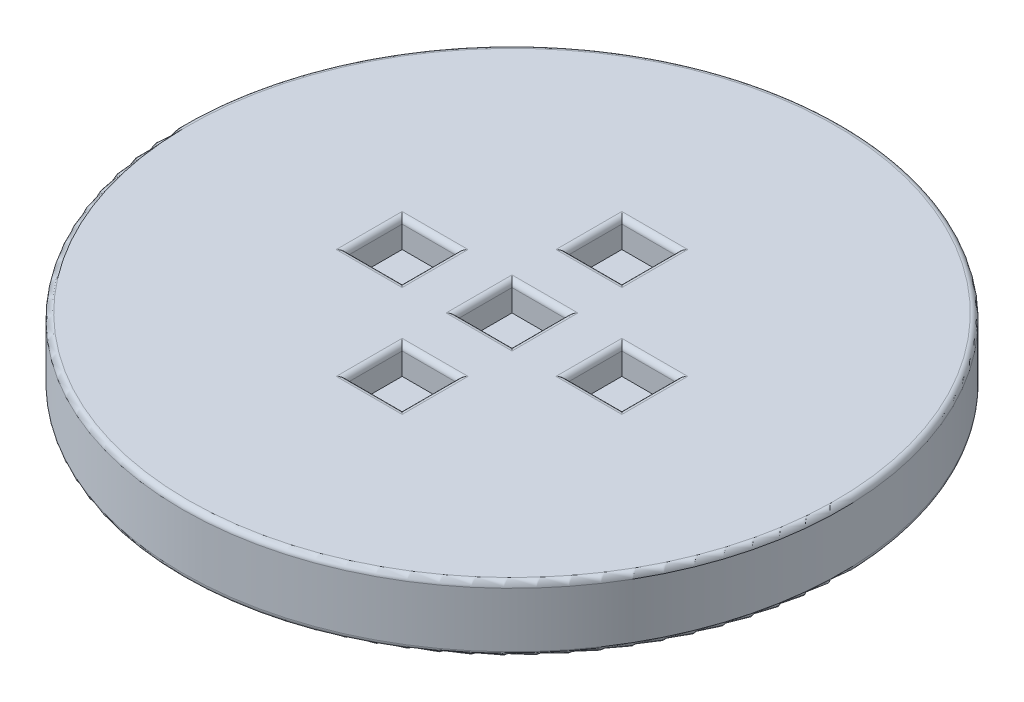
ISO-10303-21;
HEADER;
FILE_DESCRIPTION(('STEP AP214'),'2;1');
FILE_NAME('part.step','',(''),(''),'','','');
FILE_SCHEMA(('AUTOMOTIVE_DESIGN { 1 0 10303 214 1 1 1 1 }'));
ENDSEC;
DATA;
#1=APPLICATION_CONTEXT('core data for automotive mechanical design processes');
#2=APPLICATION_PROTOCOL_DEFINITION('international standard','automotive_design',2000,#1);
#3=PRODUCT_CONTEXT('',#1,'mechanical');
#4=PRODUCT('Part','Part','',(#3));
#5=PRODUCT_RELATED_PRODUCT_CATEGORY('part','',(#4));
#6=PRODUCT_DEFINITION_FORMATION('','',#4);
#7=PRODUCT_DEFINITION_CONTEXT('part definition',#1,'design');
#8=PRODUCT_DEFINITION('design','',#6,#7);
#9=PRODUCT_DEFINITION_SHAPE('','',#8);
#10=(LENGTH_UNIT() NAMED_UNIT(*) SI_UNIT(.MILLI.,.METRE.));
#11=(NAMED_UNIT(*) PLANE_ANGLE_UNIT() SI_UNIT($,.RADIAN.));
#12=(NAMED_UNIT(*) SI_UNIT($,.STERADIAN.) SOLID_ANGLE_UNIT());
#13=UNCERTAINTY_MEASURE_WITH_UNIT(LENGTH_MEASURE(1.E-05),#10,'distance_accuracy_value','');
#14=(GEOMETRIC_REPRESENTATION_CONTEXT(3) GLOBAL_UNCERTAINTY_ASSIGNED_CONTEXT((#13)) GLOBAL_UNIT_ASSIGNED_CONTEXT((#10,
#11,#12)) REPRESENTATION_CONTEXT('',''));
#15=CARTESIAN_POINT('',(0.,0.,0.));
#16=DIRECTION('',(0.,0.,1.));
#17=DIRECTION('',(1.,0.,0.));
#18=AXIS2_PLACEMENT_3D('',#15,#16,#17);
#19=CARTESIAN_POINT('',(0.,6.,0.));
#20=DIRECTION('',(0.,-1.,0.));
#21=DIRECTION('',(0.,0.,-1.));
#22=AXIS2_PLACEMENT_3D('',#19,#20,#21);
#23=CYLINDRICAL_SURFACE('',#22,30.);
#24=CARTESIAN_POINT('',(0.,5.5,0.));
#25=DIRECTION('',(0.,1.,0.));
#26=DIRECTION('',(0.,0.,1.));
#27=AXIS2_PLACEMENT_3D('',#24,#25,#26);
#28=CIRCLE('',#27,30.);
#29=CARTESIAN_POINT('',(0.,5.5,30.));
#30=VERTEX_POINT('',#29);
#31=EDGE_CURVE('E881',#30,#30,#28,.F.);
#32=ORIENTED_EDGE('',*,*,#31,.T.);
#33=EDGE_LOOP('',(#32));
#34=FACE_BOUND('',#33,.T.);
#35=CARTESIAN_POINT('',(0.,0.5,0.));
#36=DIRECTION('',(0.,1.,0.));
#37=DIRECTION('',(0.,0.,1.));
#38=AXIS2_PLACEMENT_3D('',#35,#36,#37);
#39=CIRCLE('',#38,30.);
#40=CARTESIAN_POINT('',(0.,0.5,30.));
#41=VERTEX_POINT('',#40);
#42=EDGE_CURVE('E693',#41,#41,#39,.T.);
#43=ORIENTED_EDGE('',*,*,#42,.T.);
#44=EDGE_LOOP('',(#43));
#45=FACE_BOUND('',#44,.T.);
#46=ADVANCED_FACE('F33',(#34,#45),#23,.T.);
#47=CARTESIAN_POINT('',(0.,6.,0.));
#48=DIRECTION('',(0.,1.,0.));
#49=DIRECTION('',(0.,0.,1.));
#50=AXIS2_PLACEMENT_3D('',#47,#48,#49);
#51=PLANE('',#50);
#52=CARTESIAN_POINT('',(0.,6.,0.));
#53=DIRECTION('',(0.,1.,0.));
#54=DIRECTION('',(0.,0.,1.));
#55=AXIS2_PLACEMENT_3D('',#52,#53,#54);
#56=CIRCLE('',#55,29.5);
#57=CARTESIAN_POINT('',(0.,6.,29.5));
#58=VERTEX_POINT('',#57);
#59=EDGE_CURVE('E878',#58,#58,#56,.T.);
#60=ORIENTED_EDGE('',*,*,#59,.T.);
#61=EDGE_LOOP('',(#60));
#62=FACE_BOUND('',#61,.T.);
#63=DIRECTION('',(0.,0.,1.));
#64=VECTOR('',#63,1.);
#65=CARTESIAN_POINT('',(-3.,6.,7.5));
#66=LINE('',#65,#64);
#67=CARTESIAN_POINT('',(-3.,6.,13.));
#68=VERTEX_POINT('',#67);
#69=CARTESIAN_POINT('',(-3.,6.,7.));
#70=VERTEX_POINT('',#69);
#71=EDGE_CURVE('E873',#68,#70,#66,.F.);
#72=ORIENTED_EDGE('',*,*,#71,.T.);
#73=DIRECTION('',(-1.,0.,0.));
#74=VECTOR('',#73,1.);
#75=CARTESIAN_POINT('',(2.5,6.,7.));
#76=LINE('',#75,#74);
#77=CARTESIAN_POINT('',(3.,6.,7.));
#78=VERTEX_POINT('',#77);
#79=EDGE_CURVE('E875',#70,#78,#76,.F.);
#80=ORIENTED_EDGE('',*,*,#79,.T.);
#81=DIRECTION('',(0.,0.,-1.));
#82=VECTOR('',#81,1.);
#83=CARTESIAN_POINT('',(3.,6.,12.5));
#84=LINE('',#83,#82);
#85=CARTESIAN_POINT('',(3.,6.,13.));
#86=VERTEX_POINT('',#85);
#87=EDGE_CURVE('E869',#78,#86,#84,.F.);
#88=ORIENTED_EDGE('',*,*,#87,.T.);
#89=DIRECTION('',(1.,0.,0.));
#90=VECTOR('',#89,1.);
#91=CARTESIAN_POINT('',(-2.5,6.,13.));
#92=LINE('',#91,#90);
#93=EDGE_CURVE('E871',#86,#68,#92,.F.);
#94=ORIENTED_EDGE('',*,*,#93,.T.);
#95=EDGE_LOOP('',(#72,#80,#88,#94));
#96=FACE_BOUND('',#95,.T.);
#97=DIRECTION('',(0.,0.,1.));
#98=VECTOR('',#97,1.);
#99=CARTESIAN_POINT('',(-3.,6.,-12.5));
#100=LINE('',#99,#98);
#101=CARTESIAN_POINT('',(-3.,6.,-7.));
#102=VERTEX_POINT('',#101);
#103=CARTESIAN_POINT('',(-3.,6.,-13.));
#104=VERTEX_POINT('',#103);
#105=EDGE_CURVE('E859',#102,#104,#100,.F.);
#106=ORIENTED_EDGE('',*,*,#105,.T.);
#107=DIRECTION('',(-1.,0.,0.));
#108=VECTOR('',#107,1.);
#109=CARTESIAN_POINT('',(2.5,6.,-13.));
#110=LINE('',#109,#108);
#111=CARTESIAN_POINT('',(3.,6.,-13.));
#112=VERTEX_POINT('',#111);
#113=EDGE_CURVE('E861',#104,#112,#110,.F.);
#114=ORIENTED_EDGE('',*,*,#113,.T.);
#115=DIRECTION('',(0.,0.,-1.));
#116=VECTOR('',#115,1.);
#117=CARTESIAN_POINT('',(3.,6.,-7.5));
#118=LINE('',#117,#116);
#119=CARTESIAN_POINT('',(3.,6.,-7.));
#120=VERTEX_POINT('',#119);
#121=EDGE_CURVE('E855',#112,#120,#118,.F.);
#122=ORIENTED_EDGE('',*,*,#121,.T.);
#123=DIRECTION('',(1.,0.,0.));
#124=VECTOR('',#123,1.);
#125=CARTESIAN_POINT('',(-2.5,6.,-7.));
#126=LINE('',#125,#124);
#127=EDGE_CURVE('E857',#120,#102,#126,.F.);
#128=ORIENTED_EDGE('',*,*,#127,.T.);
#129=EDGE_LOOP('',(#106,#114,#122,#128));
#130=FACE_BOUND('',#129,.T.);
#131=DIRECTION('',(0.,0.,-1.));
#132=VECTOR('',#131,1.);
#133=CARTESIAN_POINT('',(13.,6.,2.5));
#134=LINE('',#133,#132);
#135=CARTESIAN_POINT('',(13.,6.,-3.));
#136=VERTEX_POINT('',#135);
#137=CARTESIAN_POINT('',(13.,6.,3.));
#138=VERTEX_POINT('',#137);
#139=EDGE_CURVE('E850',#136,#138,#134,.F.);
#140=ORIENTED_EDGE('',*,*,#139,.T.);
#141=DIRECTION('',(1.,0.,0.));
#142=VECTOR('',#141,1.);
#143=CARTESIAN_POINT('',(7.5,6.,3.));
#144=LINE('',#143,#142);
#145=CARTESIAN_POINT('',(7.,6.,3.));
#146=VERTEX_POINT('',#145);
#147=EDGE_CURVE('E852',#138,#146,#144,.F.);
#148=ORIENTED_EDGE('',*,*,#147,.T.);
#149=DIRECTION('',(0.,0.,1.));
#150=VECTOR('',#149,1.);
#151=CARTESIAN_POINT('',(7.,6.,-2.5));
#152=LINE('',#151,#150);
#153=CARTESIAN_POINT('',(7.,6.,-3.));
#154=VERTEX_POINT('',#153);
#155=EDGE_CURVE('E799',#146,#154,#152,.F.);
#156=ORIENTED_EDGE('',*,*,#155,.T.);
#157=DIRECTION('',(-1.,0.,0.));
#158=VECTOR('',#157,1.);
#159=CARTESIAN_POINT('',(12.5,6.,-3.));
#160=LINE('',#159,#158);
#161=EDGE_CURVE('E848',#154,#136,#160,.F.);
#162=ORIENTED_EDGE('',*,*,#161,.T.);
#163=EDGE_LOOP('',(#140,#148,#156,#162));
#164=FACE_BOUND('',#163,.T.);
#165=DIRECTION('',(1.,0.,0.));
#166=VECTOR('',#165,1.);
#167=CARTESIAN_POINT('',(-12.5,6.,3.));
#168=LINE('',#167,#166);
#169=CARTESIAN_POINT('',(-7.,6.,3.));
#170=VERTEX_POINT('',#169);
#171=CARTESIAN_POINT('',(-13.,6.,3.));
#172=VERTEX_POINT('',#171);
#173=EDGE_CURVE('E673',#170,#172,#168,.F.);
#174=ORIENTED_EDGE('',*,*,#173,.T.);
#175=DIRECTION('',(0.,0.,1.));
#176=VECTOR('',#175,1.);
#177=CARTESIAN_POINT('',(-13.,6.,-2.5));
#178=LINE('',#177,#176);
#179=CARTESIAN_POINT('',(-13.,6.,-3.));
#180=VERTEX_POINT('',#179);
#181=EDGE_CURVE('E675',#172,#180,#178,.F.);
#182=ORIENTED_EDGE('',*,*,#181,.T.);
#183=DIRECTION('',(-1.,0.,0.));
#184=VECTOR('',#183,1.);
#185=CARTESIAN_POINT('',(-7.5,6.,-3.));
#186=LINE('',#185,#184);
#187=CARTESIAN_POINT('',(-7.,6.,-3.));
#188=VERTEX_POINT('',#187);
#189=EDGE_CURVE('E669',#180,#188,#186,.F.);
#190=ORIENTED_EDGE('',*,*,#189,.T.);
#191=DIRECTION('',(0.,0.,-1.));
#192=VECTOR('',#191,1.);
#193=CARTESIAN_POINT('',(-7.,6.,2.5));
#194=LINE('',#193,#192);
#195=EDGE_CURVE('E671',#188,#170,#194,.F.);
#196=ORIENTED_EDGE('',*,*,#195,.T.);
#197=EDGE_LOOP('',(#174,#182,#190,#196));
#198=FACE_BOUND('',#197,.T.);
#199=DIRECTION('',(1.,0.,0.));
#200=VECTOR('',#199,1.);
#201=CARTESIAN_POINT('',(-2.5,6.,3.));
#202=LINE('',#201,#200);
#203=CARTESIAN_POINT('',(3.,6.,3.));
#204=VERTEX_POINT('',#203);
#205=CARTESIAN_POINT('',(-3.,6.,3.));
#206=VERTEX_POINT('',#205);
#207=EDGE_CURVE('E678',#204,#206,#202,.F.);
#208=ORIENTED_EDGE('',*,*,#207,.T.);
#209=DIRECTION('',(0.,0.,1.));
#210=VECTOR('',#209,1.);
#211=CARTESIAN_POINT('',(-3.,6.,-2.5));
#212=LINE('',#211,#210);
#213=CARTESIAN_POINT('',(-3.,6.,-3.));
#214=VERTEX_POINT('',#213);
#215=EDGE_CURVE('E867',#206,#214,#212,.F.);
#216=ORIENTED_EDGE('',*,*,#215,.T.);
#217=DIRECTION('',(-1.,0.,0.));
#218=VECTOR('',#217,1.);
#219=CARTESIAN_POINT('',(3.,6.,-3.));
#220=LINE('',#219,#218);
#221=CARTESIAN_POINT('',(3.,6.,-3.));
#222=VERTEX_POINT('',#221);
#223=EDGE_CURVE('E864',#214,#222,#220,.F.);
#224=ORIENTED_EDGE('',*,*,#223,.T.);
#225=DIRECTION('',(0.,0.,-1.));
#226=VECTOR('',#225,1.);
#227=CARTESIAN_POINT('',(3.,6.,2.5));
#228=LINE('',#227,#226);
#229=EDGE_CURVE('E680',#222,#204,#228,.F.);
#230=ORIENTED_EDGE('',*,*,#229,.T.);
#231=EDGE_LOOP('',(#208,#216,#224,#230));
#232=FACE_BOUND('',#231,.T.);
#233=ADVANCED_FACE('F956',(#62,#96,#130,#164,#198,#232),#51,.T.);
#234=CARTESIAN_POINT('',(0.,0.,0.));
#235=DIRECTION('',(0.,1.,0.));
#236=DIRECTION('',(0.,0.,1.));
#237=AXIS2_PLACEMENT_3D('',#234,#235,#236);
#238=PLANE('',#237);
#239=CARTESIAN_POINT('',(0.,0.,0.));
#240=DIRECTION('',(0.,1.,0.));
#241=DIRECTION('',(0.,0.,1.));
#242=AXIS2_PLACEMENT_3D('',#239,#240,#241);
#243=CIRCLE('',#242,29.5);
#244=CARTESIAN_POINT('',(0.,0.,29.5));
#245=VERTEX_POINT('',#244);
#246=EDGE_CURVE('E752',#245,#245,#243,.F.);
#247=ORIENTED_EDGE('',*,*,#246,.T.);
#248=EDGE_LOOP('',(#247));
#249=FACE_BOUND('',#248,.T.);
#250=DIRECTION('',(-1.,0.,0.));
#251=VECTOR('',#250,1.);
#252=CARTESIAN_POINT('',(0.,0.,3.));
#253=LINE('',#252,#251);
#254=CARTESIAN_POINT('',(-3.,0.,3.));
#255=VERTEX_POINT('',#254);
#256=CARTESIAN_POINT('',(3.,0.,3.));
#257=VERTEX_POINT('',#256);
#258=EDGE_CURVE('E747',#255,#257,#253,.F.);
#259=ORIENTED_EDGE('',*,*,#258,.T.);
#260=DIRECTION('',(0.,0.,1.));
#261=VECTOR('',#260,1.);
#262=CARTESIAN_POINT('',(3.,0.,0.));
#263=LINE('',#262,#261);
#264=CARTESIAN_POINT('',(3.,0.,-3.));
#265=VERTEX_POINT('',#264);
#266=EDGE_CURVE('E749',#257,#265,#263,.F.);
#267=ORIENTED_EDGE('',*,*,#266,.T.);
#268=DIRECTION('',(1.,0.,0.));
#269=VECTOR('',#268,1.);
#270=CARTESIAN_POINT('',(0.,0.,-3.));
#271=LINE('',#270,#269);
#272=CARTESIAN_POINT('',(-3.,0.,-3.));
#273=VERTEX_POINT('',#272);
#274=EDGE_CURVE('E743',#265,#273,#271,.F.);
#275=ORIENTED_EDGE('',*,*,#274,.T.);
#276=DIRECTION('',(0.,0.,-1.));
#277=VECTOR('',#276,1.);
#278=CARTESIAN_POINT('',(-3.,0.,0.));
#279=LINE('',#278,#277);
#280=EDGE_CURVE('E745',#273,#255,#279,.F.);
#281=ORIENTED_EDGE('',*,*,#280,.T.);
#282=EDGE_LOOP('',(#259,#267,#275,#281));
#283=FACE_BOUND('',#282,.T.);
#284=DIRECTION('',(-1.,0.,0.));
#285=VECTOR('',#284,1.);
#286=CARTESIAN_POINT('',(0.,0.,13.));
#287=LINE('',#286,#285);
#288=CARTESIAN_POINT('',(-3.,0.,13.));
#289=VERTEX_POINT('',#288);
#290=CARTESIAN_POINT('',(3.,0.,13.));
#291=VERTEX_POINT('',#290);
#292=EDGE_CURVE('E738',#289,#291,#287,.F.);
#293=ORIENTED_EDGE('',*,*,#292,.T.);
#294=DIRECTION('',(0.,0.,1.));
#295=VECTOR('',#294,1.);
#296=CARTESIAN_POINT('',(3.,0.,0.));
#297=LINE('',#296,#295);
#298=CARTESIAN_POINT('',(3.,0.,7.));
#299=VERTEX_POINT('',#298);
#300=EDGE_CURVE('E740',#291,#299,#297,.F.);
#301=ORIENTED_EDGE('',*,*,#300,.T.);
#302=DIRECTION('',(1.,0.,0.));
#303=VECTOR('',#302,1.);
#304=CARTESIAN_POINT('',(0.,0.,7.));
#305=LINE('',#304,#303);
#306=CARTESIAN_POINT('',(-3.,0.,7.));
#307=VERTEX_POINT('',#306);
#308=EDGE_CURVE('E734',#299,#307,#305,.F.);
#309=ORIENTED_EDGE('',*,*,#308,.T.);
#310=DIRECTION('',(0.,0.,-1.));
#311=VECTOR('',#310,1.);
#312=CARTESIAN_POINT('',(-3.,0.,0.));
#313=LINE('',#312,#311);
#314=EDGE_CURVE('E736',#307,#289,#313,.F.);
#315=ORIENTED_EDGE('',*,*,#314,.T.);
#316=EDGE_LOOP('',(#293,#301,#309,#315));
#317=FACE_BOUND('',#316,.T.);
#318=DIRECTION('',(-1.,0.,0.));
#319=VECTOR('',#318,1.);
#320=CARTESIAN_POINT('',(0.,0.,3.));
#321=LINE('',#320,#319);
#322=CARTESIAN_POINT('',(-13.,0.,3.));
#323=VERTEX_POINT('',#322);
#324=CARTESIAN_POINT('',(-7.,0.,3.));
#325=VERTEX_POINT('',#324);
#326=EDGE_CURVE('E729',#323,#325,#321,.F.);
#327=ORIENTED_EDGE('',*,*,#326,.T.);
#328=DIRECTION('',(0.,0.,1.));
#329=VECTOR('',#328,1.);
#330=CARTESIAN_POINT('',(-7.,0.,0.));
#331=LINE('',#330,#329);
#332=CARTESIAN_POINT('',(-7.,0.,-3.));
#333=VERTEX_POINT('',#332);
#334=EDGE_CURVE('E731',#325,#333,#331,.F.);
#335=ORIENTED_EDGE('',*,*,#334,.T.);
#336=DIRECTION('',(1.,0.,0.));
#337=VECTOR('',#336,1.);
#338=CARTESIAN_POINT('',(0.,0.,-3.));
#339=LINE('',#338,#337);
#340=CARTESIAN_POINT('',(-13.,0.,-3.));
#341=VERTEX_POINT('',#340);
#342=EDGE_CURVE('E725',#333,#341,#339,.F.);
#343=ORIENTED_EDGE('',*,*,#342,.T.);
#344=DIRECTION('',(0.,0.,-1.));
#345=VECTOR('',#344,1.);
#346=CARTESIAN_POINT('',(-13.,0.,0.));
#347=LINE('',#346,#345);
#348=EDGE_CURVE('E727',#341,#323,#347,.F.);
#349=ORIENTED_EDGE('',*,*,#348,.T.);
#350=EDGE_LOOP('',(#327,#335,#343,#349));
#351=FACE_BOUND('',#350,.T.);
#352=DIRECTION('',(-1.,0.,0.));
#353=VECTOR('',#352,1.);
#354=CARTESIAN_POINT('',(0.,0.,3.));
#355=LINE('',#354,#353);
#356=CARTESIAN_POINT('',(7.,0.,3.));
#357=VERTEX_POINT('',#356);
#358=CARTESIAN_POINT('',(13.,0.,3.));
#359=VERTEX_POINT('',#358);
#360=EDGE_CURVE('E720',#357,#359,#355,.F.);
#361=ORIENTED_EDGE('',*,*,#360,.T.);
#362=DIRECTION('',(0.,0.,1.));
#363=VECTOR('',#362,1.);
#364=CARTESIAN_POINT('',(13.,0.,0.));
#365=LINE('',#364,#363);
#366=CARTESIAN_POINT('',(13.,0.,-2.99999999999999));
#367=VERTEX_POINT('',#366);
#368=EDGE_CURVE('E722',#359,#367,#365,.F.);
#369=ORIENTED_EDGE('',*,*,#368,.T.);
#370=DIRECTION('',(1.,0.,0.));
#371=VECTOR('',#370,1.);
#372=CARTESIAN_POINT('',(0.,0.,-3.));
#373=LINE('',#372,#371);
#374=CARTESIAN_POINT('',(7.,0.,-2.99999999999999));
#375=VERTEX_POINT('',#374);
#376=EDGE_CURVE('E716',#367,#375,#373,.F.);
#377=ORIENTED_EDGE('',*,*,#376,.T.);
#378=DIRECTION('',(0.,0.,-1.));
#379=VECTOR('',#378,1.);
#380=CARTESIAN_POINT('',(7.,0.,0.));
#381=LINE('',#380,#379);
#382=EDGE_CURVE('E718',#375,#357,#381,.F.);
#383=ORIENTED_EDGE('',*,*,#382,.T.);
#384=EDGE_LOOP('',(#361,#369,#377,#383));
#385=FACE_BOUND('',#384,.T.);
#386=DIRECTION('',(1.,0.,0.));
#387=VECTOR('',#386,1.);
#388=CARTESIAN_POINT('',(0.,0.,-13.));
#389=LINE('',#388,#387);
#390=CARTESIAN_POINT('',(3.,0.,-13.));
#391=VERTEX_POINT('',#390);
#392=CARTESIAN_POINT('',(-3.,0.,-13.));
#393=VERTEX_POINT('',#392);
#394=EDGE_CURVE('E711',#391,#393,#389,.F.);
#395=ORIENTED_EDGE('',*,*,#394,.T.);
#396=DIRECTION('',(0.,0.,-1.));
#397=VECTOR('',#396,1.);
#398=CARTESIAN_POINT('',(-3.,0.,0.));
#399=LINE('',#398,#397);
#400=CARTESIAN_POINT('',(-3.,0.,-7.));
#401=VERTEX_POINT('',#400);
#402=EDGE_CURVE('E713',#393,#401,#399,.F.);
#403=ORIENTED_EDGE('',*,*,#402,.T.);
#404=DIRECTION('',(-1.,0.,0.));
#405=VECTOR('',#404,1.);
#406=CARTESIAN_POINT('',(0.,0.,-7.));
#407=LINE('',#406,#405);
#408=CARTESIAN_POINT('',(3.,0.,-7.));
#409=VERTEX_POINT('',#408);
#410=EDGE_CURVE('E707',#401,#409,#407,.F.);
#411=ORIENTED_EDGE('',*,*,#410,.T.);
#412=DIRECTION('',(0.,0.,1.));
#413=VECTOR('',#412,1.);
#414=CARTESIAN_POINT('',(3.,0.,0.));
#415=LINE('',#414,#413);
#416=EDGE_CURVE('E709',#409,#391,#415,.F.);
#417=ORIENTED_EDGE('',*,*,#416,.T.);
#418=EDGE_LOOP('',(#395,#403,#411,#417));
#419=FACE_BOUND('',#418,.T.);
#420=ADVANCED_FACE('F992',(#249,#283,#317,#351,#385,#419),#238,.F.);
#421=CARTESIAN_POINT('',(2.5,3.5,7.5));
#422=DIRECTION('',(1.,0.,0.));
#423=DIRECTION('',(0.,0.,-1.));
#424=AXIS2_PLACEMENT_3D('',#421,#422,#423);
#425=PLANE('',#424);
#426=DIRECTION('',(0.,1.,0.));
#427=VECTOR('',#426,1.);
#428=CARTESIAN_POINT('',(2.5,3.5,12.5));
#429=LINE('',#428,#427);
#430=CARTESIAN_POINT('',(2.5,3.5,12.5));
#431=VERTEX_POINT('',#430);
#432=CARTESIAN_POINT('',(2.5,5.5,12.5));
#433=VERTEX_POINT('',#432);
#434=EDGE_CURVE('E655',#431,#433,#429,.T.);
#435=ORIENTED_EDGE('',*,*,#434,.T.);
#436=DIRECTION('',(0.,0.,-1.));
#437=VECTOR('',#436,1.);
#438=CARTESIAN_POINT('',(2.5,5.5,7.5));
#439=LINE('',#438,#437);
#440=CARTESIAN_POINT('',(2.5,5.5,7.5));
#441=VERTEX_POINT('',#440);
#442=EDGE_CURVE('E891',#433,#441,#439,.T.);
#443=ORIENTED_EDGE('',*,*,#442,.T.);
#444=DIRECTION('',(0.,1.,0.));
#445=VECTOR('',#444,1.);
#446=CARTESIAN_POINT('',(2.5,3.5,7.5));
#447=LINE('',#446,#445);
#448=CARTESIAN_POINT('',(2.5,3.5,7.5));
#449=VERTEX_POINT('',#448);
#450=EDGE_CURVE('E654',#449,#441,#447,.T.);
#451=ORIENTED_EDGE('',*,*,#450,.F.);
#452=DIRECTION('',(0.,0.,-1.));
#453=VECTOR('',#452,1.);
#454=CARTESIAN_POINT('',(2.5,3.5,7.5));
#455=LINE('',#454,#453);
#456=EDGE_CURVE('E634',#431,#449,#455,.T.);
#457=ORIENTED_EDGE('',*,*,#456,.F.);
#458=EDGE_LOOP('',(#435,#443,#451,#457));
#459=FACE_BOUND('',#458,.T.);
#460=ADVANCED_FACE('F1655',(#459),#425,.F.);
#461=CARTESIAN_POINT('',(-2.5,3.5,12.5));
#462=DIRECTION('',(0.,0.,1.));
#463=DIRECTION('',(1.,0.,0.));
#464=AXIS2_PLACEMENT_3D('',#461,#462,#463);
#465=PLANE('',#464);
#466=DIRECTION('',(0.,1.,0.));
#467=VECTOR('',#466,1.);
#468=CARTESIAN_POINT('',(-2.5,3.5,12.5));
#469=LINE('',#468,#467);
#470=CARTESIAN_POINT('',(-2.5,3.5,12.5));
#471=VERTEX_POINT('',#470);
#472=CARTESIAN_POINT('',(-2.5,5.5,12.5));
#473=VERTEX_POINT('',#472);
#474=EDGE_CURVE('E659',#471,#473,#469,.T.);
#475=ORIENTED_EDGE('',*,*,#474,.T.);
#476=DIRECTION('',(1.,0.,0.));
#477=VECTOR('',#476,1.);
#478=CARTESIAN_POINT('',(2.5,5.5,12.5));
#479=LINE('',#478,#477);
#480=EDGE_CURVE('E889',#473,#433,#479,.T.);
#481=ORIENTED_EDGE('',*,*,#480,.T.);
#482=ORIENTED_EDGE('',*,*,#434,.F.);
#483=DIRECTION('',(1.,0.,0.));
#484=VECTOR('',#483,1.);
#485=CARTESIAN_POINT('',(-2.5,3.5,12.5));
#486=LINE('',#485,#484);
#487=EDGE_CURVE('E651',#471,#431,#486,.T.);
#488=ORIENTED_EDGE('',*,*,#487,.F.);
#489=EDGE_LOOP('',(#475,#481,#482,#488));
#490=FACE_BOUND('',#489,.T.);
#491=ADVANCED_FACE('F1645',(#490),#465,.F.);
#492=CARTESIAN_POINT('',(-2.5,3.5,7.5));
#493=DIRECTION('',(-1.,0.,0.));
#494=DIRECTION('',(0.,0.,1.));
#495=AXIS2_PLACEMENT_3D('',#492,#493,#494);
#496=PLANE('',#495);
#497=DIRECTION('',(0.,1.,0.));
#498=VECTOR('',#497,1.);
#499=CARTESIAN_POINT('',(-2.5,3.5,7.5));
#500=LINE('',#499,#498);
#501=CARTESIAN_POINT('',(-2.5,3.5,7.5));
#502=VERTEX_POINT('',#501);
#503=CARTESIAN_POINT('',(-2.5,5.5,7.5));
#504=VERTEX_POINT('',#503);
#505=EDGE_CURVE('E662',#502,#504,#500,.T.);
#506=ORIENTED_EDGE('',*,*,#505,.T.);
#507=DIRECTION('',(0.,0.,1.));
#508=VECTOR('',#507,1.);
#509=CARTESIAN_POINT('',(-2.5,5.5,12.5));
#510=LINE('',#509,#508);
#511=EDGE_CURVE('E887',#504,#473,#510,.T.);
#512=ORIENTED_EDGE('',*,*,#511,.T.);
#513=ORIENTED_EDGE('',*,*,#474,.F.);
#514=DIRECTION('',(0.,0.,1.));
#515=VECTOR('',#514,1.);
#516=CARTESIAN_POINT('',(-2.5,3.5,7.5));
#517=LINE('',#516,#515);
#518=EDGE_CURVE('E648',#502,#471,#517,.T.);
#519=ORIENTED_EDGE('',*,*,#518,.F.);
#520=EDGE_LOOP('',(#506,#512,#513,#519));
#521=FACE_BOUND('',#520,.T.);
#522=ADVANCED_FACE('F1633',(#521),#496,.F.);
#523=CARTESIAN_POINT('',(-2.5,3.5,7.5));
#524=DIRECTION('',(0.,0.,-1.));
#525=DIRECTION('',(-1.,0.,0.));
#526=AXIS2_PLACEMENT_3D('',#523,#524,#525);
#527=PLANE('',#526);
#528=ORIENTED_EDGE('',*,*,#450,.T.);
#529=DIRECTION('',(-1.,0.,0.));
#530=VECTOR('',#529,1.);
#531=CARTESIAN_POINT('',(-2.5,5.5,7.5));
#532=LINE('',#531,#530);
#533=EDGE_CURVE('E884',#441,#504,#532,.T.);
#534=ORIENTED_EDGE('',*,*,#533,.T.);
#535=ORIENTED_EDGE('',*,*,#505,.F.);
#536=DIRECTION('',(-1.,0.,0.));
#537=VECTOR('',#536,1.);
#538=CARTESIAN_POINT('',(-2.5,3.5,7.5));
#539=LINE('',#538,#537);
#540=EDGE_CURVE('E645',#449,#502,#539,.T.);
#541=ORIENTED_EDGE('',*,*,#540,.F.);
#542=EDGE_LOOP('',(#528,#534,#535,#541));
#543=FACE_BOUND('',#542,.T.);
#544=ADVANCED_FACE('F1627',(#543),#527,.F.);
#545=CARTESIAN_POINT('',(0.,3.5,0.));
#546=DIRECTION('',(0.,1.,0.));
#547=DIRECTION('',(0.,0.,1.));
#548=AXIS2_PLACEMENT_3D('',#545,#546,#547);
#549=PLANE('',#548);
#550=ORIENTED_EDGE('',*,*,#456,.T.);
#551=ORIENTED_EDGE('',*,*,#540,.T.);
#552=ORIENTED_EDGE('',*,*,#518,.T.);
#553=ORIENTED_EDGE('',*,*,#487,.T.);
#554=EDGE_LOOP('',(#550,#551,#552,#553));
#555=FACE_BOUND('',#554,.T.);
#556=ADVANCED_FACE('F1632',(#555),#549,.T.);
#557=CARTESIAN_POINT('',(-12.5,3.5,2.5));
#558=DIRECTION('',(-1.,0.,0.));
#559=DIRECTION('',(0.,0.,1.));
#560=AXIS2_PLACEMENT_3D('',#557,#558,#559);
#561=PLANE('',#560);
#562=DIRECTION('',(0.,1.,0.));
#563=VECTOR('',#562,1.);
#564=CARTESIAN_POINT('',(-12.5,3.5,-2.5));
#565=LINE('',#564,#563);
#566=CARTESIAN_POINT('',(-12.5,3.5,-2.5));
#567=VERTEX_POINT('',#566);
#568=CARTESIAN_POINT('',(-12.5,5.5,-2.5));
#569=VERTEX_POINT('',#568);
#570=EDGE_CURVE('E631',#567,#569,#565,.T.);
#571=ORIENTED_EDGE('',*,*,#570,.T.);
#572=DIRECTION('',(0.,0.,1.));
#573=VECTOR('',#572,1.);
#574=CARTESIAN_POINT('',(-12.5,5.5,2.5));
#575=LINE('',#574,#573);
#576=CARTESIAN_POINT('',(-12.5,5.5,2.5));
#577=VERTEX_POINT('',#576);
#578=EDGE_CURVE('E684',#569,#577,#575,.T.);
#579=ORIENTED_EDGE('',*,*,#578,.T.);
#580=DIRECTION('',(0.,1.,0.));
#581=VECTOR('',#580,1.);
#582=CARTESIAN_POINT('',(-12.5,3.5,2.5));
#583=LINE('',#582,#581);
#584=CARTESIAN_POINT('',(-12.5,3.5,2.5));
#585=VERTEX_POINT('',#584);
#586=EDGE_CURVE('E630',#585,#577,#583,.T.);
#587=ORIENTED_EDGE('',*,*,#586,.F.);
#588=DIRECTION('',(0.,0.,1.));
#589=VECTOR('',#588,1.);
#590=CARTESIAN_POINT('',(-12.5,3.5,2.5));
#591=LINE('',#590,#589);
#592=EDGE_CURVE('E610',#567,#585,#591,.T.);
#593=ORIENTED_EDGE('',*,*,#592,.F.);
#594=EDGE_LOOP('',(#571,#579,#587,#593));
#595=FACE_BOUND('',#594,.T.);
#596=ADVANCED_FACE('F1770',(#595),#561,.F.);
#597=CARTESIAN_POINT('',(-7.5,3.5,-2.5));
#598=DIRECTION('',(0.,0.,-1.));
#599=DIRECTION('',(-1.,0.,0.));
#600=AXIS2_PLACEMENT_3D('',#597,#598,#599);
#601=PLANE('',#600);
#602=DIRECTION('',(0.,1.,0.));
#603=VECTOR('',#602,1.);
#604=CARTESIAN_POINT('',(-7.5,3.5,-2.5));
#605=LINE('',#604,#603);
#606=CARTESIAN_POINT('',(-7.5,3.5,-2.5));
#607=VERTEX_POINT('',#606);
#608=CARTESIAN_POINT('',(-7.5,5.5,-2.5));
#609=VERTEX_POINT('',#608);
#610=EDGE_CURVE('E635',#607,#609,#605,.T.);
#611=ORIENTED_EDGE('',*,*,#610,.T.);
#612=DIRECTION('',(-1.,0.,0.));
#613=VECTOR('',#612,1.);
#614=CARTESIAN_POINT('',(-12.5,5.5,-2.5));
#615=LINE('',#614,#613);
#616=EDGE_CURVE('E691',#609,#569,#615,.T.);
#617=ORIENTED_EDGE('',*,*,#616,.T.);
#618=ORIENTED_EDGE('',*,*,#570,.F.);
#619=DIRECTION('',(-1.,0.,0.));
#620=VECTOR('',#619,1.);
#621=CARTESIAN_POINT('',(-7.5,3.5,-2.5));
#622=LINE('',#621,#620);
#623=EDGE_CURVE('E627',#607,#567,#622,.T.);
#624=ORIENTED_EDGE('',*,*,#623,.F.);
#625=EDGE_LOOP('',(#611,#617,#618,#624));
#626=FACE_BOUND('',#625,.T.);
#627=ADVANCED_FACE('F1774',(#626),#601,.F.);
#628=CARTESIAN_POINT('',(-7.5,3.5,2.5));
#629=DIRECTION('',(1.,0.,0.));
#630=DIRECTION('',(0.,0.,-1.));
#631=AXIS2_PLACEMENT_3D('',#628,#629,#630);
#632=PLANE('',#631);
#633=DIRECTION('',(0.,1.,0.));
#634=VECTOR('',#633,1.);
#635=CARTESIAN_POINT('',(-7.5,3.5,2.5));
#636=LINE('',#635,#634);
#637=CARTESIAN_POINT('',(-7.5,3.5,2.5));
#638=VERTEX_POINT('',#637);
#639=CARTESIAN_POINT('',(-7.5,5.5,2.5));
#640=VERTEX_POINT('',#639);
#641=EDGE_CURVE('E638',#638,#640,#636,.T.);
#642=ORIENTED_EDGE('',*,*,#641,.T.);
#643=DIRECTION('',(0.,0.,-1.));
#644=VECTOR('',#643,1.);
#645=CARTESIAN_POINT('',(-7.5,5.5,-2.5));
#646=LINE('',#645,#644);
#647=EDGE_CURVE('E689',#640,#609,#646,.T.);
#648=ORIENTED_EDGE('',*,*,#647,.T.);
#649=ORIENTED_EDGE('',*,*,#610,.F.);
#650=DIRECTION('',(0.,0.,-1.));
#651=VECTOR('',#650,1.);
#652=CARTESIAN_POINT('',(-7.5,3.5,2.5));
#653=LINE('',#652,#651);
#654=EDGE_CURVE('E624',#638,#607,#653,.T.);
#655=ORIENTED_EDGE('',*,*,#654,.F.);
#656=EDGE_LOOP('',(#642,#648,#649,#655));
#657=FACE_BOUND('',#656,.T.);
#658=ADVANCED_FACE('F1779',(#657),#632,.F.);
#659=CARTESIAN_POINT('',(-7.5,3.5,2.5));
#660=DIRECTION('',(0.,0.,1.));
#661=DIRECTION('',(1.,0.,0.));
#662=AXIS2_PLACEMENT_3D('',#659,#660,#661);
#663=PLANE('',#662);
#664=ORIENTED_EDGE('',*,*,#586,.T.);
#665=DIRECTION('',(1.,0.,0.));
#666=VECTOR('',#665,1.);
#667=CARTESIAN_POINT('',(-7.5,5.5,2.5));
#668=LINE('',#667,#666);
#669=EDGE_CURVE('E687',#577,#640,#668,.T.);
#670=ORIENTED_EDGE('',*,*,#669,.T.);
#671=ORIENTED_EDGE('',*,*,#641,.F.);
#672=DIRECTION('',(1.,0.,0.));
#673=VECTOR('',#672,1.);
#674=CARTESIAN_POINT('',(-7.5,3.5,2.5));
#675=LINE('',#674,#673);
#676=EDGE_CURVE('E621',#585,#638,#675,.T.);
#677=ORIENTED_EDGE('',*,*,#676,.F.);
#678=EDGE_LOOP('',(#664,#670,#671,#677));
#679=FACE_BOUND('',#678,.T.);
#680=ADVANCED_FACE('F1776',(#679),#663,.F.);
#681=CARTESIAN_POINT('',(0.,3.5,0.));
#682=DIRECTION('',(0.,1.,0.));
#683=DIRECTION('',(0.,0.,1.));
#684=AXIS2_PLACEMENT_3D('',#681,#682,#683);
#685=PLANE('',#684);
#686=ORIENTED_EDGE('',*,*,#592,.T.);
#687=ORIENTED_EDGE('',*,*,#676,.T.);
#688=ORIENTED_EDGE('',*,*,#654,.T.);
#689=ORIENTED_EDGE('',*,*,#623,.T.);
#690=EDGE_LOOP('',(#686,#687,#688,#689));
#691=FACE_BOUND('',#690,.T.);
#692=ADVANCED_FACE('F1619',(#691),#685,.T.);
#693=CARTESIAN_POINT('',(-2.5,3.5,2.5));
#694=DIRECTION('',(-1.,0.,0.));
#695=DIRECTION('',(0.,0.,1.));
#696=AXIS2_PLACEMENT_3D('',#693,#694,#695);
#697=PLANE('',#696);
#698=DIRECTION('',(0.,1.,0.));
#699=VECTOR('',#698,1.);
#700=CARTESIAN_POINT('',(-2.5,3.5,-2.5));
#701=LINE('',#700,#699);
#702=CARTESIAN_POINT('',(-2.5,3.5,-2.5));
#703=VERTEX_POINT('',#702);
#704=CARTESIAN_POINT('',(-2.5,5.5,-2.5));
#705=VERTEX_POINT('',#704);
#706=EDGE_CURVE('E607',#703,#705,#701,.T.);
#707=ORIENTED_EDGE('',*,*,#706,.T.);
#708=DIRECTION('',(0.,0.,1.));
#709=VECTOR('',#708,1.);
#710=CARTESIAN_POINT('',(-2.5,5.5,3.));
#711=LINE('',#710,#709);
#712=CARTESIAN_POINT('',(-2.5,5.5,2.5));
#713=VERTEX_POINT('',#712);
#714=EDGE_CURVE('E893',#705,#713,#711,.T.);
#715=ORIENTED_EDGE('',*,*,#714,.T.);
#716=DIRECTION('',(0.,1.,0.));
#717=VECTOR('',#716,1.);
#718=CARTESIAN_POINT('',(-2.5,3.5,2.5));
#719=LINE('',#718,#717);
#720=CARTESIAN_POINT('',(-2.5,3.5,2.5));
#721=VERTEX_POINT('',#720);
#722=EDGE_CURVE('E606',#721,#713,#719,.T.);
#723=ORIENTED_EDGE('',*,*,#722,.F.);
#724=DIRECTION('',(0.,0.,1.));
#725=VECTOR('',#724,1.);
#726=CARTESIAN_POINT('',(-2.5,3.5,2.5));
#727=LINE('',#726,#725);
#728=EDGE_CURVE('E586',#703,#721,#727,.T.);
#729=ORIENTED_EDGE('',*,*,#728,.F.);
#730=EDGE_LOOP('',(#707,#715,#723,#729));
#731=FACE_BOUND('',#730,.T.);
#732=ADVANCED_FACE('F1609',(#731),#697,.F.);
#733=CARTESIAN_POINT('',(2.5,3.5,-2.5));
#734=DIRECTION('',(0.,0.,-1.));
#735=DIRECTION('',(-1.,0.,0.));
#736=AXIS2_PLACEMENT_3D('',#733,#734,#735);
#737=PLANE('',#736);
#738=DIRECTION('',(0.,1.,0.));
#739=VECTOR('',#738,1.);
#740=CARTESIAN_POINT('',(2.5,3.5,-2.5));
#741=LINE('',#740,#739);
#742=CARTESIAN_POINT('',(2.5,3.5,-2.5));
#743=VERTEX_POINT('',#742);
#744=CARTESIAN_POINT('',(2.5,5.5,-2.5));
#745=VERTEX_POINT('',#744);
#746=EDGE_CURVE('E611',#743,#745,#741,.T.);
#747=ORIENTED_EDGE('',*,*,#746,.T.);
#748=DIRECTION('',(-1.,0.,0.));
#749=VECTOR('',#748,1.);
#750=CARTESIAN_POINT('',(-2.5,5.5,-2.5));
#751=LINE('',#750,#749);
#752=EDGE_CURVE('E896',#745,#705,#751,.T.);
#753=ORIENTED_EDGE('',*,*,#752,.T.);
#754=ORIENTED_EDGE('',*,*,#706,.F.);
#755=DIRECTION('',(-1.,0.,0.));
#756=VECTOR('',#755,1.);
#757=CARTESIAN_POINT('',(2.5,3.5,-2.5));
#758=LINE('',#757,#756);
#759=EDGE_CURVE('E603',#743,#703,#758,.T.);
#760=ORIENTED_EDGE('',*,*,#759,.F.);
#761=EDGE_LOOP('',(#747,#753,#754,#760));
#762=FACE_BOUND('',#761,.T.);
#763=ADVANCED_FACE('F1599',(#762),#737,.F.);
#764=CARTESIAN_POINT('',(2.5,3.5,2.5));
#765=DIRECTION('',(1.,0.,0.));
#766=DIRECTION('',(0.,0.,-1.));
#767=AXIS2_PLACEMENT_3D('',#764,#765,#766);
#768=PLANE('',#767);
#769=DIRECTION('',(0.,1.,0.));
#770=VECTOR('',#769,1.);
#771=CARTESIAN_POINT('',(2.5,3.5,2.5));
#772=LINE('',#771,#770);
#773=CARTESIAN_POINT('',(2.5,3.5,2.5));
#774=VERTEX_POINT('',#773);
#775=CARTESIAN_POINT('',(2.5,5.5,2.5));
#776=VERTEX_POINT('',#775);
#777=EDGE_CURVE('E614',#774,#776,#772,.T.);
#778=ORIENTED_EDGE('',*,*,#777,.T.);
#779=DIRECTION('',(0.,0.,-1.));
#780=VECTOR('',#779,1.);
#781=CARTESIAN_POINT('',(2.5,5.5,-2.5));
#782=LINE('',#781,#780);
#783=EDGE_CURVE('E658',#776,#745,#782,.T.);
#784=ORIENTED_EDGE('',*,*,#783,.T.);
#785=ORIENTED_EDGE('',*,*,#746,.F.);
#786=DIRECTION('',(0.,0.,-1.));
#787=VECTOR('',#786,1.);
#788=CARTESIAN_POINT('',(2.5,3.5,2.5));
#789=LINE('',#788,#787);
#790=EDGE_CURVE('E600',#774,#743,#789,.T.);
#791=ORIENTED_EDGE('',*,*,#790,.F.);
#792=EDGE_LOOP('',(#778,#784,#785,#791));
#793=FACE_BOUND('',#792,.T.);
#794=ADVANCED_FACE('F1589',(#793),#768,.F.);
#795=CARTESIAN_POINT('',(2.5,3.5,2.5));
#796=DIRECTION('',(0.,0.,1.));
#797=DIRECTION('',(1.,0.,0.));
#798=AXIS2_PLACEMENT_3D('',#795,#796,#797);
#799=PLANE('',#798);
#800=ORIENTED_EDGE('',*,*,#722,.T.);
#801=DIRECTION('',(1.,0.,0.));
#802=VECTOR('',#801,1.);
#803=CARTESIAN_POINT('',(2.5,5.5,2.5));
#804=LINE('',#803,#802);
#805=EDGE_CURVE('E682',#713,#776,#804,.T.);
#806=ORIENTED_EDGE('',*,*,#805,.T.);
#807=ORIENTED_EDGE('',*,*,#777,.F.);
#808=DIRECTION('',(1.,0.,0.));
#809=VECTOR('',#808,1.);
#810=CARTESIAN_POINT('',(2.5,3.5,2.5));
#811=LINE('',#810,#809);
#812=EDGE_CURVE('E597',#721,#774,#811,.T.);
#813=ORIENTED_EDGE('',*,*,#812,.F.);
#814=EDGE_LOOP('',(#800,#806,#807,#813));
#815=FACE_BOUND('',#814,.T.);
#816=ADVANCED_FACE('F1584',(#815),#799,.F.);
#817=CARTESIAN_POINT('',(0.,3.5,0.));
#818=DIRECTION('',(0.,1.,0.));
#819=DIRECTION('',(0.,0.,1.));
#820=AXIS2_PLACEMENT_3D('',#817,#818,#819);
#821=PLANE('',#820);
#822=ORIENTED_EDGE('',*,*,#728,.T.);
#823=ORIENTED_EDGE('',*,*,#812,.T.);
#824=ORIENTED_EDGE('',*,*,#790,.T.);
#825=ORIENTED_EDGE('',*,*,#759,.T.);
#826=EDGE_LOOP('',(#822,#823,#824,#825));
#827=FACE_BOUND('',#826,.T.);
#828=ADVANCED_FACE('F1576',(#827),#821,.T.);
#829=CARTESIAN_POINT('',(2.5,3.5,-12.5));
#830=DIRECTION('',(1.,0.,0.));
#831=DIRECTION('',(0.,0.,-1.));
#832=AXIS2_PLACEMENT_3D('',#829,#830,#831);
#833=PLANE('',#832);
#834=DIRECTION('',(0.,1.,0.));
#835=VECTOR('',#834,1.);
#836=CARTESIAN_POINT('',(2.5,3.5,-7.5));
#837=LINE('',#836,#835);
#838=CARTESIAN_POINT('',(2.5,3.5,-7.5));
#839=VERTEX_POINT('',#838);
#840=CARTESIAN_POINT('',(2.5,5.5,-7.5));
#841=VERTEX_POINT('',#840);
#842=EDGE_CURVE('E583',#839,#841,#837,.T.);
#843=ORIENTED_EDGE('',*,*,#842,.T.);
#844=DIRECTION('',(0.,0.,-1.));
#845=VECTOR('',#844,1.);
#846=CARTESIAN_POINT('',(2.5,5.5,-12.5));
#847=LINE('',#846,#845);
#848=CARTESIAN_POINT('',(2.5,5.5,-12.5));
#849=VERTEX_POINT('',#848);
#850=EDGE_CURVE('E905',#841,#849,#847,.T.);
#851=ORIENTED_EDGE('',*,*,#850,.T.);
#852=DIRECTION('',(0.,1.,0.));
#853=VECTOR('',#852,1.);
#854=CARTESIAN_POINT('',(2.5,3.5,-12.5));
#855=LINE('',#854,#853);
#856=CARTESIAN_POINT('',(2.5,3.5,-12.5));
#857=VERTEX_POINT('',#856);
#858=EDGE_CURVE('E582',#857,#849,#855,.T.);
#859=ORIENTED_EDGE('',*,*,#858,.F.);
#860=DIRECTION('',(0.,0.,-1.));
#861=VECTOR('',#860,1.);
#862=CARTESIAN_POINT('',(2.5,3.5,-12.5));
#863=LINE('',#862,#861);
#864=EDGE_CURVE('E564',#839,#857,#863,.T.);
#865=ORIENTED_EDGE('',*,*,#864,.F.);
#866=EDGE_LOOP('',(#843,#851,#859,#865));
#867=FACE_BOUND('',#866,.T.);
#868=ADVANCED_FACE('F1566',(#867),#833,.F.);
#869=CARTESIAN_POINT('',(-2.5,3.5,-7.5));
#870=DIRECTION('',(0.,0.,1.));
#871=DIRECTION('',(1.,0.,0.));
#872=AXIS2_PLACEMENT_3D('',#869,#870,#871);
#873=PLANE('',#872);
#874=DIRECTION('',(0.,1.,0.));
#875=VECTOR('',#874,1.);
#876=CARTESIAN_POINT('',(-2.5,3.5,-7.5));
#877=LINE('',#876,#875);
#878=CARTESIAN_POINT('',(-2.5,3.5,-7.5));
#879=VERTEX_POINT('',#878);
#880=CARTESIAN_POINT('',(-2.5,5.5,-7.5));
#881=VERTEX_POINT('',#880);
#882=EDGE_CURVE('E587',#879,#881,#877,.T.);
#883=ORIENTED_EDGE('',*,*,#882,.T.);
#884=DIRECTION('',(1.,0.,0.));
#885=VECTOR('',#884,1.);
#886=CARTESIAN_POINT('',(2.5,5.5,-7.5));
#887=LINE('',#886,#885);
#888=EDGE_CURVE('E903',#881,#841,#887,.T.);
#889=ORIENTED_EDGE('',*,*,#888,.T.);
#890=ORIENTED_EDGE('',*,*,#842,.F.);
#891=DIRECTION('',(1.,0.,0.));
#892=VECTOR('',#891,1.);
#893=CARTESIAN_POINT('',(-2.5,3.5,-7.5));
#894=LINE('',#893,#892);
#895=EDGE_CURVE('E579',#879,#839,#894,.T.);
#896=ORIENTED_EDGE('',*,*,#895,.F.);
#897=EDGE_LOOP('',(#883,#889,#890,#896));
#898=FACE_BOUND('',#897,.T.);
#899=ADVANCED_FACE('F1556',(#898),#873,.F.);
#900=CARTESIAN_POINT('',(-2.5,3.5,-12.5));
#901=DIRECTION('',(-1.,0.,0.));
#902=DIRECTION('',(0.,0.,1.));
#903=AXIS2_PLACEMENT_3D('',#900,#901,#902);
#904=PLANE('',#903);
#905=DIRECTION('',(0.,1.,0.));
#906=VECTOR('',#905,1.);
#907=CARTESIAN_POINT('',(-2.5,3.5,-12.5));
#908=LINE('',#907,#906);
#909=CARTESIAN_POINT('',(-2.5,3.5,-12.5));
#910=VERTEX_POINT('',#909);
#911=CARTESIAN_POINT('',(-2.5,5.5,-12.5));
#912=VERTEX_POINT('',#911);
#913=EDGE_CURVE('E590',#910,#912,#908,.T.);
#914=ORIENTED_EDGE('',*,*,#913,.T.);
#915=DIRECTION('',(0.,0.,1.));
#916=VECTOR('',#915,1.);
#917=CARTESIAN_POINT('',(-2.5,5.5,-7.5));
#918=LINE('',#917,#916);
#919=EDGE_CURVE('E901',#912,#881,#918,.T.);
#920=ORIENTED_EDGE('',*,*,#919,.T.);
#921=ORIENTED_EDGE('',*,*,#882,.F.);
#922=DIRECTION('',(0.,0.,1.));
#923=VECTOR('',#922,1.);
#924=CARTESIAN_POINT('',(-2.5,3.5,-12.5));
#925=LINE('',#924,#923);
#926=EDGE_CURVE('E576',#910,#879,#925,.T.);
#927=ORIENTED_EDGE('',*,*,#926,.F.);
#928=EDGE_LOOP('',(#914,#920,#921,#927));
#929=FACE_BOUND('',#928,.T.);
#930=ADVANCED_FACE('F1546',(#929),#904,.F.);
#931=CARTESIAN_POINT('',(-2.5,3.5,-12.5));
#932=DIRECTION('',(0.,0.,-1.));
#933=DIRECTION('',(-1.,0.,0.));
#934=AXIS2_PLACEMENT_3D('',#931,#932,#933);
#935=PLANE('',#934);
#936=ORIENTED_EDGE('',*,*,#858,.T.);
#937=DIRECTION('',(-1.,0.,0.));
#938=VECTOR('',#937,1.);
#939=CARTESIAN_POINT('',(-2.5,5.5,-12.5));
#940=LINE('',#939,#938);
#941=EDGE_CURVE('E898',#849,#912,#940,.T.);
#942=ORIENTED_EDGE('',*,*,#941,.T.);
#943=ORIENTED_EDGE('',*,*,#913,.F.);
#944=DIRECTION('',(-1.,0.,0.));
#945=VECTOR('',#944,1.);
#946=CARTESIAN_POINT('',(-2.5,3.5,-12.5));
#947=LINE('',#946,#945);
#948=EDGE_CURVE('E573',#857,#910,#947,.T.);
#949=ORIENTED_EDGE('',*,*,#948,.F.);
#950=EDGE_LOOP('',(#936,#942,#943,#949));
#951=FACE_BOUND('',#950,.T.);
#952=ADVANCED_FACE('F1541',(#951),#935,.F.);
#953=CARTESIAN_POINT('',(0.,3.5,0.));
#954=DIRECTION('',(0.,1.,0.));
#955=DIRECTION('',(0.,0.,1.));
#956=AXIS2_PLACEMENT_3D('',#953,#954,#955);
#957=PLANE('',#956);
#958=ORIENTED_EDGE('',*,*,#864,.T.);
#959=ORIENTED_EDGE('',*,*,#948,.T.);
#960=ORIENTED_EDGE('',*,*,#926,.T.);
#961=ORIENTED_EDGE('',*,*,#895,.T.);
#962=EDGE_LOOP('',(#958,#959,#960,#961));
#963=FACE_BOUND('',#962,.T.);
#964=ADVANCED_FACE('F983',(#963),#957,.T.);
#965=CARTESIAN_POINT('',(7.5,3.5,2.5));
#966=DIRECTION('',(-1.,0.,0.));
#967=DIRECTION('',(0.,0.,1.));
#968=AXIS2_PLACEMENT_3D('',#965,#966,#967);
#969=PLANE('',#968);
#970=DIRECTION('',(0.,1.,0.));
#971=VECTOR('',#970,1.);
#972=CARTESIAN_POINT('',(7.5,3.5,-2.5));
#973=LINE('',#972,#971);
#974=CARTESIAN_POINT('',(7.5,3.5,-2.5));
#975=VERTEX_POINT('',#974);
#976=CARTESIAN_POINT('',(7.5,5.5,-2.5));
#977=VERTEX_POINT('',#976);
#978=EDGE_CURVE('E562',#975,#977,#973,.T.);
#979=ORIENTED_EDGE('',*,*,#978,.T.);
#980=DIRECTION('',(0.,0.,1.));
#981=VECTOR('',#980,1.);
#982=CARTESIAN_POINT('',(7.5,5.5,2.5));
#983=LINE('',#982,#981);
#984=CARTESIAN_POINT('',(7.5,5.5,2.5));
#985=VERTEX_POINT('',#984);
#986=EDGE_CURVE('E912',#977,#985,#983,.T.);
#987=ORIENTED_EDGE('',*,*,#986,.T.);
#988=DIRECTION('',(0.,1.,0.));
#989=VECTOR('',#988,1.);
#990=CARTESIAN_POINT('',(7.5,3.5,2.5));
#991=LINE('',#990,#989);
#992=CARTESIAN_POINT('',(7.5,3.5,2.5));
#993=VERTEX_POINT('',#992);
#994=EDGE_CURVE('E561',#993,#985,#991,.T.);
#995=ORIENTED_EDGE('',*,*,#994,.F.);
#996=DIRECTION('',(0.,0.,1.));
#997=VECTOR('',#996,1.);
#998=CARTESIAN_POINT('',(7.5,3.5,2.5));
#999=LINE('',#998,#997);
#1000=EDGE_CURVE('E548',#975,#993,#999,.T.);
#1001=ORIENTED_EDGE('',*,*,#1000,.F.);
#1002=EDGE_LOOP('',(#979,#987,#995,#1001));
#1003=FACE_BOUND('',#1002,.T.);
#1004=ADVANCED_FACE('F974',(#1003),#969,.F.);
#1005=CARTESIAN_POINT('',(12.5,3.5,-2.5));
#1006=DIRECTION('',(0.,0.,-1.));
#1007=DIRECTION('',(-1.,0.,0.));
#1008=AXIS2_PLACEMENT_3D('',#1005,#1006,#1007);
#1009=PLANE('',#1008);
#1010=DIRECTION('',(0.,1.,0.));
#1011=VECTOR('',#1010,1.);
#1012=CARTESIAN_POINT('',(12.5,3.5,-2.5));
#1013=LINE('',#1012,#1011);
#1014=CARTESIAN_POINT('',(12.5,3.5,-2.5));
#1015=VERTEX_POINT('',#1014);
#1016=CARTESIAN_POINT('',(12.5,5.5,-2.5));
#1017=VERTEX_POINT('',#1016);
#1018=EDGE_CURVE('E565',#1015,#1017,#1013,.T.);
#1019=ORIENTED_EDGE('',*,*,#1018,.T.);
#1020=DIRECTION('',(-1.,0.,0.));
#1021=VECTOR('',#1020,1.);
#1022=CARTESIAN_POINT('',(7.5,5.5,-2.5));
#1023=LINE('',#1022,#1021);
#1024=EDGE_CURVE('E50',#1017,#977,#1023,.T.);
#1025=ORIENTED_EDGE('',*,*,#1024,.T.);
#1026=ORIENTED_EDGE('',*,*,#978,.F.);
#1027=DIRECTION('',(-1.,0.,0.));
#1028=VECTOR('',#1027,1.);
#1029=CARTESIAN_POINT('',(12.5,3.5,-2.5));
#1030=LINE('',#1029,#1028);
#1031=EDGE_CURVE('E558',#1015,#975,#1030,.T.);
#1032=ORIENTED_EDGE('',*,*,#1031,.F.);
#1033=EDGE_LOOP('',(#1019,#1025,#1026,#1032));
#1034=FACE_BOUND('',#1033,.T.);
#1035=ADVANCED_FACE('F975',(#1034),#1009,.F.);
#1036=CARTESIAN_POINT('',(12.5,3.5,2.5));
#1037=DIRECTION('',(1.,0.,0.));
#1038=DIRECTION('',(0.,0.,-1.));
#1039=AXIS2_PLACEMENT_3D('',#1036,#1037,#1038);
#1040=PLANE('',#1039);
#1041=DIRECTION('',(0.,1.,0.));
#1042=VECTOR('',#1041,1.);
#1043=CARTESIAN_POINT('',(12.5,3.5,2.5));
#1044=LINE('',#1043,#1042);
#1045=CARTESIAN_POINT('',(12.5,3.5,2.5));
#1046=VERTEX_POINT('',#1045);
#1047=CARTESIAN_POINT('',(12.5,5.5,2.5));
#1048=VERTEX_POINT('',#1047);
#1049=EDGE_CURVE('E567',#1046,#1048,#1044,.T.);
#1050=ORIENTED_EDGE('',*,*,#1049,.T.);
#1051=DIRECTION('',(0.,0.,-1.));
#1052=VECTOR('',#1051,1.);
#1053=CARTESIAN_POINT('',(12.5,5.5,-2.5));
#1054=LINE('',#1053,#1052);
#1055=EDGE_CURVE('E58',#1048,#1017,#1054,.T.);
#1056=ORIENTED_EDGE('',*,*,#1055,.T.);
#1057=ORIENTED_EDGE('',*,*,#1018,.F.);
#1058=DIRECTION('',(0.,0.,-1.));
#1059=VECTOR('',#1058,1.);
#1060=CARTESIAN_POINT('',(12.5,3.5,2.5));
#1061=LINE('',#1060,#1059);
#1062=EDGE_CURVE('E555',#1046,#1015,#1061,.T.);
#1063=ORIENTED_EDGE('',*,*,#1062,.F.);
#1064=EDGE_LOOP('',(#1050,#1056,#1057,#1063));
#1065=FACE_BOUND('',#1064,.T.);
#1066=ADVANCED_FACE('F968',(#1065),#1040,.F.);
#1067=CARTESIAN_POINT('',(12.5,3.5,2.5));
#1068=DIRECTION('',(0.,0.,1.));
#1069=DIRECTION('',(1.,0.,0.));
#1070=AXIS2_PLACEMENT_3D('',#1067,#1068,#1069);
#1071=PLANE('',#1070);
#1072=ORIENTED_EDGE('',*,*,#994,.T.);
#1073=DIRECTION('',(1.,0.,0.));
#1074=VECTOR('',#1073,1.);
#1075=CARTESIAN_POINT('',(12.5,5.5,2.5));
#1076=LINE('',#1075,#1074);
#1077=EDGE_CURVE('E907',#985,#1048,#1076,.T.);
#1078=ORIENTED_EDGE('',*,*,#1077,.T.);
#1079=ORIENTED_EDGE('',*,*,#1049,.F.);
#1080=DIRECTION('',(1.,0.,0.));
#1081=VECTOR('',#1080,1.);
#1082=CARTESIAN_POINT('',(12.5,3.5,2.5));
#1083=LINE('',#1082,#1081);
#1084=EDGE_CURVE('E551',#993,#1046,#1083,.T.);
#1085=ORIENTED_EDGE('',*,*,#1084,.F.);
#1086=EDGE_LOOP('',(#1072,#1078,#1079,#1085));
#1087=FACE_BOUND('',#1086,.T.);
#1088=ADVANCED_FACE('F965',(#1087),#1071,.F.);
#1089=CARTESIAN_POINT('',(0.,3.5,0.));
#1090=DIRECTION('',(0.,1.,0.));
#1091=DIRECTION('',(0.,0.,1.));
#1092=AXIS2_PLACEMENT_3D('',#1089,#1090,#1091);
#1093=PLANE('',#1092);
#1094=ORIENTED_EDGE('',*,*,#1000,.T.);
#1095=ORIENTED_EDGE('',*,*,#1084,.T.);
#1096=ORIENTED_EDGE('',*,*,#1062,.T.);
#1097=ORIENTED_EDGE('',*,*,#1031,.T.);
#1098=EDGE_LOOP('',(#1094,#1095,#1096,#1097));
#1099=FACE_BOUND('',#1098,.T.);
#1100=ADVANCED_FACE('F971',(#1099),#1093,.T.);
#1101=CARTESIAN_POINT('',(2.5,5.5,3.));
#1102=DIRECTION('',(-1.,0.,0.));
#1103=DIRECTION('',(0.,0.,1.));
#1104=AXIS2_PLACEMENT_3D('',#1101,#1102,#1103);
#1105=CYLINDRICAL_SURFACE('',#1104,0.5);
#1106=ORIENTED_EDGE('',*,*,#805,.F.);
#1107=CARTESIAN_POINT('',(-3.,5.5,3.));
#1108=DIRECTION('',(-0.707106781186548,0.,-0.707106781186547));
#1109=DIRECTION('',(0.707106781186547,0.,-0.707106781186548));
#1110=AXIS2_PLACEMENT_3D('',#1107,#1108,#1109);
#1111=ELLIPSE('',#1110,0.707106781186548,0.5);
#1112=EDGE_CURVE('E42',#713,#206,#1111,.F.);
#1113=ORIENTED_EDGE('',*,*,#1112,.T.);
#1114=ORIENTED_EDGE('',*,*,#207,.F.);
#1115=CARTESIAN_POINT('',(3.,5.5,3.));
#1116=DIRECTION('',(-0.707106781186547,0.,0.707106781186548));
#1117=DIRECTION('',(0.707106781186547,0.,0.707106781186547));
#1118=AXIS2_PLACEMENT_3D('',#1115,#1116,#1117);
#1119=ELLIPSE('',#1118,0.707106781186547,0.5);
#1120=EDGE_CURVE('E552',#776,#204,#1119,.F.);
#1121=ORIENTED_EDGE('',*,*,#1120,.F.);
#1122=EDGE_LOOP('',(#1106,#1113,#1114,#1121));
#1123=FACE_BOUND('',#1122,.T.);
#1124=ADVANCED_FACE('F1002',(#1123),#1105,.T.);
#1125=CARTESIAN_POINT('',(3.,5.5,2.5));
#1126=DIRECTION('',(0.,0.,1.));
#1127=DIRECTION('',(1.,0.,0.));
#1128=AXIS2_PLACEMENT_3D('',#1125,#1126,#1127);
#1129=CYLINDRICAL_SURFACE('',#1128,0.5);
#1130=ORIENTED_EDGE('',*,*,#1120,.T.);
#1131=ORIENTED_EDGE('',*,*,#229,.F.);
#1132=CARTESIAN_POINT('',(3.,5.5,-3.));
#1133=DIRECTION('',(0.707106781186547,0.,0.707106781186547));
#1134=DIRECTION('',(0.707106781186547,0.,-0.707106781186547));
#1135=AXIS2_PLACEMENT_3D('',#1132,#1133,#1134);
#1136=ELLIPSE('',#1135,0.707106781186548,0.5);
#1137=EDGE_CURVE('E11',#222,#745,#1136,.T.);
#1138=ORIENTED_EDGE('',*,*,#1137,.T.);
#1139=ORIENTED_EDGE('',*,*,#783,.F.);
#1140=EDGE_LOOP('',(#1130,#1131,#1138,#1139));
#1141=FACE_BOUND('',#1140,.T.);
#1142=ADVANCED_FACE('F998',(#1141),#1129,.T.);
#1143=CARTESIAN_POINT('',(-7.,5.5,2.5));
#1144=DIRECTION('',(0.,0.,1.));
#1145=DIRECTION('',(1.,0.,0.));
#1146=AXIS2_PLACEMENT_3D('',#1143,#1144,#1145);
#1147=CYLINDRICAL_SURFACE('',#1146,0.5);
#1148=CARTESIAN_POINT('',(-7.,5.5,3.));
#1149=DIRECTION('',(-0.707106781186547,0.,0.707106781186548));
#1150=DIRECTION('',(-0.707106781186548,0.,-0.707106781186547));
#1151=AXIS2_PLACEMENT_3D('',#1148,#1149,#1150);
#1152=ELLIPSE('',#1151,0.707106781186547,0.5);
#1153=EDGE_CURVE('E700',#170,#640,#1152,.T.);
#1154=ORIENTED_EDGE('',*,*,#1153,.F.);
#1155=ORIENTED_EDGE('',*,*,#195,.F.);
#1156=CARTESIAN_POINT('',(-7.,5.5,-3.));
#1157=DIRECTION('',(0.707106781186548,0.,0.707106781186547));
#1158=DIRECTION('',(-0.707106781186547,0.,0.707106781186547));
#1159=AXIS2_PLACEMENT_3D('',#1156,#1157,#1158);
#1160=ELLIPSE('',#1159,0.707106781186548,0.5);
#1161=EDGE_CURVE('E696',#609,#188,#1160,.F.);
#1162=ORIENTED_EDGE('',*,*,#1161,.F.);
#1163=ORIENTED_EDGE('',*,*,#647,.F.);
#1164=EDGE_LOOP('',(#1154,#1155,#1162,#1163));
#1165=FACE_BOUND('',#1164,.T.);
#1166=ADVANCED_FACE('F1001',(#1165),#1147,.T.);
#1167=CARTESIAN_POINT('',(-7.5,5.5,-3.));
#1168=DIRECTION('',(1.,0.,0.));
#1169=DIRECTION('',(0.,0.,-1.));
#1170=AXIS2_PLACEMENT_3D('',#1167,#1168,#1169);
#1171=CYLINDRICAL_SURFACE('',#1170,0.5);
#1172=ORIENTED_EDGE('',*,*,#1161,.T.);
#1173=ORIENTED_EDGE('',*,*,#189,.F.);
#1174=CARTESIAN_POINT('',(-13.,5.5,-3.));
#1175=DIRECTION('',(0.707106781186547,0.,-0.707106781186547));
#1176=DIRECTION('',(-0.707106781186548,0.,-0.707106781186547));
#1177=AXIS2_PLACEMENT_3D('',#1174,#1175,#1176);
#1178=ELLIPSE('',#1177,0.707106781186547,0.5);
#1179=EDGE_CURVE('E698',#569,#180,#1178,.F.);
#1180=ORIENTED_EDGE('',*,*,#1179,.F.);
#1181=ORIENTED_EDGE('',*,*,#616,.F.);
#1182=EDGE_LOOP('',(#1172,#1173,#1180,#1181));
#1183=FACE_BOUND('',#1182,.T.);
#1184=ADVANCED_FACE('F1015',(#1183),#1171,.T.);
#1185=CARTESIAN_POINT('',(-7.5,5.5,3.));
#1186=DIRECTION('',(-1.,0.,0.));
#1187=DIRECTION('',(0.,0.,1.));
#1188=AXIS2_PLACEMENT_3D('',#1185,#1186,#1187);
#1189=CYLINDRICAL_SURFACE('',#1188,0.5);
#1190=ORIENTED_EDGE('',*,*,#1153,.T.);
#1191=ORIENTED_EDGE('',*,*,#669,.F.);
#1192=CARTESIAN_POINT('',(-13.,5.5,3.));
#1193=DIRECTION('',(-0.707106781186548,0.,-0.707106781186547));
#1194=DIRECTION('',(0.707106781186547,0.,-0.707106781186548));
#1195=AXIS2_PLACEMENT_3D('',#1192,#1193,#1194);
#1196=ELLIPSE('',#1195,0.707106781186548,0.5);
#1197=EDGE_CURVE('E539',#172,#577,#1196,.T.);
#1198=ORIENTED_EDGE('',*,*,#1197,.F.);
#1199=ORIENTED_EDGE('',*,*,#173,.F.);
#1200=EDGE_LOOP('',(#1190,#1191,#1198,#1199));
#1201=FACE_BOUND('',#1200,.T.);
#1202=ADVANCED_FACE('F1011',(#1201),#1189,.T.);
#1203=CARTESIAN_POINT('',(-13.,5.5,2.5));
#1204=DIRECTION('',(0.,0.,-1.));
#1205=DIRECTION('',(-1.,0.,0.));
#1206=AXIS2_PLACEMENT_3D('',#1203,#1204,#1205);
#1207=CYLINDRICAL_SURFACE('',#1206,0.5);
#1208=ORIENTED_EDGE('',*,*,#1179,.T.);
#1209=ORIENTED_EDGE('',*,*,#181,.F.);
#1210=ORIENTED_EDGE('',*,*,#1197,.T.);
#1211=ORIENTED_EDGE('',*,*,#578,.F.);
#1212=EDGE_LOOP('',(#1208,#1209,#1210,#1211));
#1213=FACE_BOUND('',#1212,.T.);
#1214=ADVANCED_FACE('F1007',(#1213),#1207,.T.);
#1215=CARTESIAN_POINT('',(-2.5,2.5,-2.5));
#1216=DIRECTION('',(-1.,0.,0.));
#1217=DIRECTION('',(0.,0.,1.));
#1218=AXIS2_PLACEMENT_3D('',#1215,#1216,#1217);
#1219=PLANE('',#1218);
#1220=DIRECTION('',(0.,-1.,0.));
#1221=VECTOR('',#1220,1.);
#1222=CARTESIAN_POINT('',(-2.5,2.5,2.5));
#1223=LINE('',#1222,#1221);
#1224=CARTESIAN_POINT('',(-2.5,2.5,2.5));
#1225=VERTEX_POINT('',#1224);
#1226=CARTESIAN_POINT('',(-2.5,0.5,2.5));
#1227=VERTEX_POINT('',#1226);
#1228=EDGE_CURVE('E536',#1225,#1227,#1223,.T.);
#1229=ORIENTED_EDGE('',*,*,#1228,.T.);
#1230=DIRECTION('',(0.,0.,-1.));
#1231=VECTOR('',#1230,1.);
#1232=CARTESIAN_POINT('',(-2.5,0.5,-2.5));
#1233=LINE('',#1232,#1231);
#1234=CARTESIAN_POINT('',(-2.5,0.5,-2.5));
#1235=VERTEX_POINT('',#1234);
#1236=EDGE_CURVE('E760',#1227,#1235,#1233,.T.);
#1237=ORIENTED_EDGE('',*,*,#1236,.T.);
#1238=DIRECTION('',(0.,-1.,0.));
#1239=VECTOR('',#1238,1.);
#1240=CARTESIAN_POINT('',(-2.5,2.5,-2.5));
#1241=LINE('',#1240,#1239);
#1242=CARTESIAN_POINT('',(-2.5,2.5,-2.5));
#1243=VERTEX_POINT('',#1242);
#1244=EDGE_CURVE('E535',#1243,#1235,#1241,.T.);
#1245=ORIENTED_EDGE('',*,*,#1244,.F.);
#1246=DIRECTION('',(0.,0.,-1.));
#1247=VECTOR('',#1246,1.);
#1248=CARTESIAN_POINT('',(-2.5,2.5,-2.5));
#1249=LINE('',#1248,#1247);
#1250=EDGE_CURVE('E515',#1225,#1243,#1249,.T.);
#1251=ORIENTED_EDGE('',*,*,#1250,.F.);
#1252=EDGE_LOOP('',(#1229,#1237,#1245,#1251));
#1253=FACE_BOUND('',#1252,.T.);
#1254=ADVANCED_FACE('F1010',(#1253),#1219,.F.);
#1255=CARTESIAN_POINT('',(2.5,2.5,2.5));
#1256=DIRECTION('',(0.,0.,1.));
#1257=DIRECTION('',(1.,0.,0.));
#1258=AXIS2_PLACEMENT_3D('',#1255,#1256,#1257);
#1259=PLANE('',#1258);
#1260=DIRECTION('',(0.,-1.,0.));
#1261=VECTOR('',#1260,1.);
#1262=CARTESIAN_POINT('',(2.5,2.5,2.5));
#1263=LINE('',#1262,#1261);
#1264=CARTESIAN_POINT('',(2.5,2.5,2.5));
#1265=VERTEX_POINT('',#1264);
#1266=CARTESIAN_POINT('',(2.5,0.5,2.5));
#1267=VERTEX_POINT('',#1266);
#1268=EDGE_CURVE('E540',#1265,#1267,#1263,.T.);
#1269=ORIENTED_EDGE('',*,*,#1268,.T.);
#1270=DIRECTION('',(-1.,0.,0.));
#1271=VECTOR('',#1270,1.);
#1272=CARTESIAN_POINT('',(2.5,0.5,2.5));
#1273=LINE('',#1272,#1271);
#1274=EDGE_CURVE('E758',#1267,#1227,#1273,.T.);
#1275=ORIENTED_EDGE('',*,*,#1274,.T.);
#1276=ORIENTED_EDGE('',*,*,#1228,.F.);
#1277=DIRECTION('',(-1.,0.,0.));
#1278=VECTOR('',#1277,1.);
#1279=CARTESIAN_POINT('',(2.5,2.5,2.5));
#1280=LINE('',#1279,#1278);
#1281=EDGE_CURVE('E532',#1265,#1225,#1280,.T.);
#1282=ORIENTED_EDGE('',*,*,#1281,.F.);
#1283=EDGE_LOOP('',(#1269,#1275,#1276,#1282));
#1284=FACE_BOUND('',#1283,.T.);
#1285=ADVANCED_FACE('F1468',(#1284),#1259,.F.);
#1286=CARTESIAN_POINT('',(2.5,2.5,-2.5));
#1287=DIRECTION('',(1.,0.,0.));
#1288=DIRECTION('',(0.,0.,-1.));
#1289=AXIS2_PLACEMENT_3D('',#1286,#1287,#1288);
#1290=PLANE('',#1289);
#1291=DIRECTION('',(0.,-1.,0.));
#1292=VECTOR('',#1291,1.);
#1293=CARTESIAN_POINT('',(2.5,2.5,-2.5));
#1294=LINE('',#1293,#1292);
#1295=CARTESIAN_POINT('',(2.5,2.5,-2.5));
#1296=VERTEX_POINT('',#1295);
#1297=CARTESIAN_POINT('',(2.5,0.5,-2.5));
#1298=VERTEX_POINT('',#1297);
#1299=EDGE_CURVE('E543',#1296,#1298,#1294,.T.);
#1300=ORIENTED_EDGE('',*,*,#1299,.T.);
#1301=DIRECTION('',(0.,0.,1.));
#1302=VECTOR('',#1301,1.);
#1303=CARTESIAN_POINT('',(2.5,0.5,-2.5));
#1304=LINE('',#1303,#1302);
#1305=EDGE_CURVE('E755',#1298,#1267,#1304,.T.);
#1306=ORIENTED_EDGE('',*,*,#1305,.T.);
#1307=ORIENTED_EDGE('',*,*,#1268,.F.);
#1308=DIRECTION('',(0.,0.,1.));
#1309=VECTOR('',#1308,1.);
#1310=CARTESIAN_POINT('',(2.5,2.5,-2.5));
#1311=LINE('',#1310,#1309);
#1312=EDGE_CURVE('E529',#1296,#1265,#1311,.T.);
#1313=ORIENTED_EDGE('',*,*,#1312,.F.);
#1314=EDGE_LOOP('',(#1300,#1306,#1307,#1313));
#1315=FACE_BOUND('',#1314,.T.);
#1316=ADVANCED_FACE('F1460',(#1315),#1290,.F.);
#1317=CARTESIAN_POINT('',(2.5,2.5,-2.5));
#1318=DIRECTION('',(0.,0.,-1.));
#1319=DIRECTION('',(-1.,0.,0.));
#1320=AXIS2_PLACEMENT_3D('',#1317,#1318,#1319);
#1321=PLANE('',#1320);
#1322=ORIENTED_EDGE('',*,*,#1244,.T.);
#1323=DIRECTION('',(1.,0.,0.));
#1324=VECTOR('',#1323,1.);
#1325=CARTESIAN_POINT('',(2.5,0.5,-2.5));
#1326=LINE('',#1325,#1324);
#1327=EDGE_CURVE('E762',#1235,#1298,#1326,.T.);
#1328=ORIENTED_EDGE('',*,*,#1327,.T.);
#1329=ORIENTED_EDGE('',*,*,#1299,.F.);
#1330=DIRECTION('',(1.,0.,0.));
#1331=VECTOR('',#1330,1.);
#1332=CARTESIAN_POINT('',(2.5,2.5,-2.5));
#1333=LINE('',#1332,#1331);
#1334=EDGE_CURVE('E526',#1243,#1296,#1333,.T.);
#1335=ORIENTED_EDGE('',*,*,#1334,.F.);
#1336=EDGE_LOOP('',(#1322,#1328,#1329,#1335));
#1337=FACE_BOUND('',#1336,.T.);
#1338=ADVANCED_FACE('F1452',(#1337),#1321,.F.);
#1339=CARTESIAN_POINT('',(0.,2.5,0.));
#1340=DIRECTION('',(0.,-1.,0.));
#1341=DIRECTION('',(0.,0.,-1.));
#1342=AXIS2_PLACEMENT_3D('',#1339,#1340,#1341);
#1343=PLANE('',#1342);
#1344=ORIENTED_EDGE('',*,*,#1250,.T.);
#1345=ORIENTED_EDGE('',*,*,#1334,.T.);
#1346=ORIENTED_EDGE('',*,*,#1312,.T.);
#1347=ORIENTED_EDGE('',*,*,#1281,.T.);
#1348=EDGE_LOOP('',(#1344,#1345,#1346,#1347));
#1349=FACE_BOUND('',#1348,.T.);
#1350=ADVANCED_FACE('F1444',(#1349),#1343,.T.);
#1351=CARTESIAN_POINT('',(-2.5,2.5,7.5));
#1352=DIRECTION('',(-1.,0.,0.));
#1353=DIRECTION('',(0.,0.,1.));
#1354=AXIS2_PLACEMENT_3D('',#1351,#1352,#1353);
#1355=PLANE('',#1354);
#1356=DIRECTION('',(0.,-1.,0.));
#1357=VECTOR('',#1356,1.);
#1358=CARTESIAN_POINT('',(-2.5,2.5,12.5));
#1359=LINE('',#1358,#1357);
#1360=CARTESIAN_POINT('',(-2.5,2.5,12.5));
#1361=VERTEX_POINT('',#1360);
#1362=CARTESIAN_POINT('',(-2.5,0.5,12.5));
#1363=VERTEX_POINT('',#1362);
#1364=EDGE_CURVE('E512',#1361,#1363,#1359,.T.);
#1365=ORIENTED_EDGE('',*,*,#1364,.T.);
#1366=DIRECTION('',(0.,0.,-1.));
#1367=VECTOR('',#1366,1.);
#1368=CARTESIAN_POINT('',(-2.5,0.5,7.5));
#1369=LINE('',#1368,#1367);
#1370=CARTESIAN_POINT('',(-2.5,0.5,7.5));
#1371=VERTEX_POINT('',#1370);
#1372=EDGE_CURVE('E769',#1363,#1371,#1369,.T.);
#1373=ORIENTED_EDGE('',*,*,#1372,.T.);
#1374=DIRECTION('',(0.,-1.,0.));
#1375=VECTOR('',#1374,1.);
#1376=CARTESIAN_POINT('',(-2.5,2.5,7.5));
#1377=LINE('',#1376,#1375);
#1378=CARTESIAN_POINT('',(-2.5,2.5,7.5));
#1379=VERTEX_POINT('',#1378);
#1380=EDGE_CURVE('E511',#1379,#1371,#1377,.T.);
#1381=ORIENTED_EDGE('',*,*,#1380,.F.);
#1382=DIRECTION('',(0.,0.,-1.));
#1383=VECTOR('',#1382,1.);
#1384=CARTESIAN_POINT('',(-2.5,2.5,7.5));
#1385=LINE('',#1384,#1383);
#1386=EDGE_CURVE('E491',#1361,#1379,#1385,.T.);
#1387=ORIENTED_EDGE('',*,*,#1386,.F.);
#1388=EDGE_LOOP('',(#1365,#1373,#1381,#1387));
#1389=FACE_BOUND('',#1388,.T.);
#1390=ADVANCED_FACE('F1436',(#1389),#1355,.F.);
#1391=CARTESIAN_POINT('',(2.5,2.5,12.5));
#1392=DIRECTION('',(0.,0.,1.));
#1393=DIRECTION('',(1.,0.,0.));
#1394=AXIS2_PLACEMENT_3D('',#1391,#1392,#1393);
#1395=PLANE('',#1394);
#1396=DIRECTION('',(0.,-1.,0.));
#1397=VECTOR('',#1396,1.);
#1398=CARTESIAN_POINT('',(2.5,2.5,12.5));
#1399=LINE('',#1398,#1397);
#1400=CARTESIAN_POINT('',(2.5,2.5,12.5));
#1401=VERTEX_POINT('',#1400);
#1402=CARTESIAN_POINT('',(2.5,0.5,12.5));
#1403=VERTEX_POINT('',#1402);
#1404=EDGE_CURVE('E516',#1401,#1403,#1399,.T.);
#1405=ORIENTED_EDGE('',*,*,#1404,.T.);
#1406=DIRECTION('',(-1.,0.,0.));
#1407=VECTOR('',#1406,1.);
#1408=CARTESIAN_POINT('',(2.5,0.5,12.5));
#1409=LINE('',#1408,#1407);
#1410=EDGE_CURVE('E767',#1403,#1363,#1409,.T.);
#1411=ORIENTED_EDGE('',*,*,#1410,.T.);
#1412=ORIENTED_EDGE('',*,*,#1364,.F.);
#1413=DIRECTION('',(-1.,0.,0.));
#1414=VECTOR('',#1413,1.);
#1415=CARTESIAN_POINT('',(2.5,2.5,12.5));
#1416=LINE('',#1415,#1414);
#1417=EDGE_CURVE('E508',#1401,#1361,#1416,.T.);
#1418=ORIENTED_EDGE('',*,*,#1417,.F.);
#1419=EDGE_LOOP('',(#1405,#1411,#1412,#1418));
#1420=FACE_BOUND('',#1419,.T.);
#1421=ADVANCED_FACE('F1428',(#1420),#1395,.F.);
#1422=CARTESIAN_POINT('',(2.5,2.5,7.5));
#1423=DIRECTION('',(1.,0.,0.));
#1424=DIRECTION('',(0.,0.,-1.));
#1425=AXIS2_PLACEMENT_3D('',#1422,#1423,#1424);
#1426=PLANE('',#1425);
#1427=DIRECTION('',(0.,-1.,0.));
#1428=VECTOR('',#1427,1.);
#1429=CARTESIAN_POINT('',(2.5,2.5,7.5));
#1430=LINE('',#1429,#1428);
#1431=CARTESIAN_POINT('',(2.5,2.5,7.5));
#1432=VERTEX_POINT('',#1431);
#1433=CARTESIAN_POINT('',(2.5,0.5,7.5));
#1434=VERTEX_POINT('',#1433);
#1435=EDGE_CURVE('E519',#1432,#1434,#1430,.T.);
#1436=ORIENTED_EDGE('',*,*,#1435,.T.);
#1437=DIRECTION('',(0.,0.,1.));
#1438=VECTOR('',#1437,1.);
#1439=CARTESIAN_POINT('',(2.5,0.5,7.5));
#1440=LINE('',#1439,#1438);
#1441=EDGE_CURVE('E764',#1434,#1403,#1440,.T.);
#1442=ORIENTED_EDGE('',*,*,#1441,.T.);
#1443=ORIENTED_EDGE('',*,*,#1404,.F.);
#1444=DIRECTION('',(0.,0.,1.));
#1445=VECTOR('',#1444,1.);
#1446=CARTESIAN_POINT('',(2.5,2.5,7.5));
#1447=LINE('',#1446,#1445);
#1448=EDGE_CURVE('E505',#1432,#1401,#1447,.T.);
#1449=ORIENTED_EDGE('',*,*,#1448,.F.);
#1450=EDGE_LOOP('',(#1436,#1442,#1443,#1449));
#1451=FACE_BOUND('',#1450,.T.);
#1452=ADVANCED_FACE('F1420',(#1451),#1426,.F.);
#1453=CARTESIAN_POINT('',(2.5,2.5,7.5));
#1454=DIRECTION('',(0.,0.,-1.));
#1455=DIRECTION('',(-1.,0.,0.));
#1456=AXIS2_PLACEMENT_3D('',#1453,#1454,#1455);
#1457=PLANE('',#1456);
#1458=ORIENTED_EDGE('',*,*,#1380,.T.);
#1459=DIRECTION('',(1.,0.,0.));
#1460=VECTOR('',#1459,1.);
#1461=CARTESIAN_POINT('',(2.5,0.5,7.5));
#1462=LINE('',#1461,#1460);
#1463=EDGE_CURVE('E771',#1371,#1434,#1462,.T.);
#1464=ORIENTED_EDGE('',*,*,#1463,.T.);
#1465=ORIENTED_EDGE('',*,*,#1435,.F.);
#1466=DIRECTION('',(1.,0.,0.));
#1467=VECTOR('',#1466,1.);
#1468=CARTESIAN_POINT('',(2.5,2.5,7.5));
#1469=LINE('',#1468,#1467);
#1470=EDGE_CURVE('E502',#1379,#1432,#1469,.T.);
#1471=ORIENTED_EDGE('',*,*,#1470,.F.);
#1472=EDGE_LOOP('',(#1458,#1464,#1465,#1471));
#1473=FACE_BOUND('',#1472,.T.);
#1474=ADVANCED_FACE('F1412',(#1473),#1457,.F.);
#1475=CARTESIAN_POINT('',(0.,2.5,0.));
#1476=DIRECTION('',(0.,-1.,0.));
#1477=DIRECTION('',(0.,0.,-1.));
#1478=AXIS2_PLACEMENT_3D('',#1475,#1476,#1477);
#1479=PLANE('',#1478);
#1480=ORIENTED_EDGE('',*,*,#1386,.T.);
#1481=ORIENTED_EDGE('',*,*,#1470,.T.);
#1482=ORIENTED_EDGE('',*,*,#1448,.T.);
#1483=ORIENTED_EDGE('',*,*,#1417,.T.);
#1484=EDGE_LOOP('',(#1480,#1481,#1482,#1483));
#1485=FACE_BOUND('',#1484,.T.);
#1486=ADVANCED_FACE('F1404',(#1485),#1479,.T.);
#1487=CARTESIAN_POINT('',(-12.5,2.5,-2.5));
#1488=DIRECTION('',(-1.,0.,0.));
#1489=DIRECTION('',(0.,0.,1.));
#1490=AXIS2_PLACEMENT_3D('',#1487,#1488,#1489);
#1491=PLANE('',#1490);
#1492=DIRECTION('',(0.,-1.,0.));
#1493=VECTOR('',#1492,1.);
#1494=CARTESIAN_POINT('',(-12.5,2.5,2.5));
#1495=LINE('',#1494,#1493);
#1496=CARTESIAN_POINT('',(-12.5,2.5,2.5));
#1497=VERTEX_POINT('',#1496);
#1498=CARTESIAN_POINT('',(-12.5,0.5,2.5));
#1499=VERTEX_POINT('',#1498);
#1500=EDGE_CURVE('E488',#1497,#1499,#1495,.T.);
#1501=ORIENTED_EDGE('',*,*,#1500,.T.);
#1502=DIRECTION('',(0.,0.,-1.));
#1503=VECTOR('',#1502,1.);
#1504=CARTESIAN_POINT('',(-12.5,0.5,-2.5));
#1505=LINE('',#1504,#1503);
#1506=CARTESIAN_POINT('',(-12.5,0.5,-2.5));
#1507=VERTEX_POINT('',#1506);
#1508=EDGE_CURVE('E778',#1499,#1507,#1505,.T.);
#1509=ORIENTED_EDGE('',*,*,#1508,.T.);
#1510=DIRECTION('',(0.,-1.,0.));
#1511=VECTOR('',#1510,1.);
#1512=CARTESIAN_POINT('',(-12.5,2.5,-2.5));
#1513=LINE('',#1512,#1511);
#1514=CARTESIAN_POINT('',(-12.5,2.5,-2.5));
#1515=VERTEX_POINT('',#1514);
#1516=EDGE_CURVE('E487',#1515,#1507,#1513,.T.);
#1517=ORIENTED_EDGE('',*,*,#1516,.F.);
#1518=DIRECTION('',(0.,0.,-1.));
#1519=VECTOR('',#1518,1.);
#1520=CARTESIAN_POINT('',(-12.5,2.5,-2.5));
#1521=LINE('',#1520,#1519);
#1522=EDGE_CURVE('E467',#1497,#1515,#1521,.T.);
#1523=ORIENTED_EDGE('',*,*,#1522,.F.);
#1524=EDGE_LOOP('',(#1501,#1509,#1517,#1523));
#1525=FACE_BOUND('',#1524,.T.);
#1526=ADVANCED_FACE('F1396',(#1525),#1491,.F.);
#1527=CARTESIAN_POINT('',(-7.5,2.5,2.5));
#1528=DIRECTION('',(0.,0.,1.));
#1529=DIRECTION('',(1.,0.,0.));
#1530=AXIS2_PLACEMENT_3D('',#1527,#1528,#1529);
#1531=PLANE('',#1530);
#1532=DIRECTION('',(0.,-1.,0.));
#1533=VECTOR('',#1532,1.);
#1534=CARTESIAN_POINT('',(-7.5,2.5,2.5));
#1535=LINE('',#1534,#1533);
#1536=CARTESIAN_POINT('',(-7.5,2.5,2.5));
#1537=VERTEX_POINT('',#1536);
#1538=CARTESIAN_POINT('',(-7.5,0.5,2.5));
#1539=VERTEX_POINT('',#1538);
#1540=EDGE_CURVE('E492',#1537,#1539,#1535,.T.);
#1541=ORIENTED_EDGE('',*,*,#1540,.T.);
#1542=DIRECTION('',(-1.,0.,0.));
#1543=VECTOR('',#1542,1.);
#1544=CARTESIAN_POINT('',(-7.5,0.5,2.5));
#1545=LINE('',#1544,#1543);
#1546=EDGE_CURVE('E776',#1539,#1499,#1545,.T.);
#1547=ORIENTED_EDGE('',*,*,#1546,.T.);
#1548=ORIENTED_EDGE('',*,*,#1500,.F.);
#1549=DIRECTION('',(-1.,0.,0.));
#1550=VECTOR('',#1549,1.);
#1551=CARTESIAN_POINT('',(-7.5,2.5,2.5));
#1552=LINE('',#1551,#1550);
#1553=EDGE_CURVE('E484',#1537,#1497,#1552,.T.);
#1554=ORIENTED_EDGE('',*,*,#1553,.F.);
#1555=EDGE_LOOP('',(#1541,#1547,#1548,#1554));
#1556=FACE_BOUND('',#1555,.T.);
#1557=ADVANCED_FACE('F1388',(#1556),#1531,.F.);
#1558=CARTESIAN_POINT('',(-7.5,2.5,-2.5));
#1559=DIRECTION('',(1.,0.,0.));
#1560=DIRECTION('',(0.,0.,-1.));
#1561=AXIS2_PLACEMENT_3D('',#1558,#1559,#1560);
#1562=PLANE('',#1561);
#1563=DIRECTION('',(0.,-1.,0.));
#1564=VECTOR('',#1563,1.);
#1565=CARTESIAN_POINT('',(-7.5,2.5,-2.5));
#1566=LINE('',#1565,#1564);
#1567=CARTESIAN_POINT('',(-7.5,2.5,-2.5));
#1568=VERTEX_POINT('',#1567);
#1569=CARTESIAN_POINT('',(-7.5,0.5,-2.5));
#1570=VERTEX_POINT('',#1569);
#1571=EDGE_CURVE('E495',#1568,#1570,#1566,.T.);
#1572=ORIENTED_EDGE('',*,*,#1571,.T.);
#1573=DIRECTION('',(0.,0.,1.));
#1574=VECTOR('',#1573,1.);
#1575=CARTESIAN_POINT('',(-7.5,0.5,-2.5));
#1576=LINE('',#1575,#1574);
#1577=EDGE_CURVE('E773',#1570,#1539,#1576,.T.);
#1578=ORIENTED_EDGE('',*,*,#1577,.T.);
#1579=ORIENTED_EDGE('',*,*,#1540,.F.);
#1580=DIRECTION('',(0.,0.,1.));
#1581=VECTOR('',#1580,1.);
#1582=CARTESIAN_POINT('',(-7.5,2.5,-2.5));
#1583=LINE('',#1582,#1581);
#1584=EDGE_CURVE('E481',#1568,#1537,#1583,.T.);
#1585=ORIENTED_EDGE('',*,*,#1584,.F.);
#1586=EDGE_LOOP('',(#1572,#1578,#1579,#1585));
#1587=FACE_BOUND('',#1586,.T.);
#1588=ADVANCED_FACE('F1380',(#1587),#1562,.F.);
#1589=CARTESIAN_POINT('',(-7.5,2.5,-2.5));
#1590=DIRECTION('',(0.,0.,-1.));
#1591=DIRECTION('',(-1.,0.,0.));
#1592=AXIS2_PLACEMENT_3D('',#1589,#1590,#1591);
#1593=PLANE('',#1592);
#1594=ORIENTED_EDGE('',*,*,#1516,.T.);
#1595=DIRECTION('',(1.,0.,0.));
#1596=VECTOR('',#1595,1.);
#1597=CARTESIAN_POINT('',(-7.5,0.5,-2.5));
#1598=LINE('',#1597,#1596);
#1599=EDGE_CURVE('E780',#1507,#1570,#1598,.T.);
#1600=ORIENTED_EDGE('',*,*,#1599,.T.);
#1601=ORIENTED_EDGE('',*,*,#1571,.F.);
#1602=DIRECTION('',(1.,0.,0.));
#1603=VECTOR('',#1602,1.);
#1604=CARTESIAN_POINT('',(-7.5,2.5,-2.5));
#1605=LINE('',#1604,#1603);
#1606=EDGE_CURVE('E478',#1515,#1568,#1605,.T.);
#1607=ORIENTED_EDGE('',*,*,#1606,.F.);
#1608=EDGE_LOOP('',(#1594,#1600,#1601,#1607));
#1609=FACE_BOUND('',#1608,.T.);
#1610=ADVANCED_FACE('F1372',(#1609),#1593,.F.);
#1611=CARTESIAN_POINT('',(0.,2.5,0.));
#1612=DIRECTION('',(0.,-1.,0.));
#1613=DIRECTION('',(0.,0.,-1.));
#1614=AXIS2_PLACEMENT_3D('',#1611,#1612,#1613);
#1615=PLANE('',#1614);
#1616=ORIENTED_EDGE('',*,*,#1522,.T.);
#1617=ORIENTED_EDGE('',*,*,#1606,.T.);
#1618=ORIENTED_EDGE('',*,*,#1584,.T.);
#1619=ORIENTED_EDGE('',*,*,#1553,.T.);
#1620=EDGE_LOOP('',(#1616,#1617,#1618,#1619));
#1621=FACE_BOUND('',#1620,.T.);
#1622=ADVANCED_FACE('F1364',(#1621),#1615,.T.);
#1623=CARTESIAN_POINT('',(7.5,2.5,-2.49999999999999));
#1624=DIRECTION('',(-1.,0.,0.));
#1625=DIRECTION('',(0.,0.,1.));
#1626=AXIS2_PLACEMENT_3D('',#1623,#1624,#1625);
#1627=PLANE('',#1626);
#1628=DIRECTION('',(0.,-1.,0.));
#1629=VECTOR('',#1628,1.);
#1630=CARTESIAN_POINT('',(7.5,2.5,2.5));
#1631=LINE('',#1630,#1629);
#1632=CARTESIAN_POINT('',(7.5,2.5,2.5));
#1633=VERTEX_POINT('',#1632);
#1634=CARTESIAN_POINT('',(7.5,0.5,2.5));
#1635=VERTEX_POINT('',#1634);
#1636=EDGE_CURVE('E464',#1633,#1635,#1631,.T.);
#1637=ORIENTED_EDGE('',*,*,#1636,.T.);
#1638=DIRECTION('',(0.,0.,-1.));
#1639=VECTOR('',#1638,1.);
#1640=CARTESIAN_POINT('',(7.5,0.5,-2.49999999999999));
#1641=LINE('',#1640,#1639);
#1642=CARTESIAN_POINT('',(7.5,0.5,-2.49999999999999));
#1643=VERTEX_POINT('',#1642);
#1644=EDGE_CURVE('E787',#1635,#1643,#1641,.T.);
#1645=ORIENTED_EDGE('',*,*,#1644,.T.);
#1646=DIRECTION('',(0.,-1.,0.));
#1647=VECTOR('',#1646,1.);
#1648=CARTESIAN_POINT('',(7.5,2.5,-2.49999999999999));
#1649=LINE('',#1648,#1647);
#1650=CARTESIAN_POINT('',(7.5,2.5,-2.49999999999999));
#1651=VERTEX_POINT('',#1650);
#1652=EDGE_CURVE('E463',#1651,#1643,#1649,.T.);
#1653=ORIENTED_EDGE('',*,*,#1652,.F.);
#1654=DIRECTION('',(0.,0.,-1.));
#1655=VECTOR('',#1654,1.);
#1656=CARTESIAN_POINT('',(7.5,2.5,-2.49999999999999));
#1657=LINE('',#1656,#1655);
#1658=EDGE_CURVE('E447',#1633,#1651,#1657,.T.);
#1659=ORIENTED_EDGE('',*,*,#1658,.F.);
#1660=EDGE_LOOP('',(#1637,#1645,#1653,#1659));
#1661=FACE_BOUND('',#1660,.T.);
#1662=ADVANCED_FACE('F1356',(#1661),#1627,.F.);
#1663=CARTESIAN_POINT('',(12.5,2.5,2.5));
#1664=DIRECTION('',(0.,0.,1.));
#1665=DIRECTION('',(1.,0.,0.));
#1666=AXIS2_PLACEMENT_3D('',#1663,#1664,#1665);
#1667=PLANE('',#1666);
#1668=DIRECTION('',(0.,-1.,0.));
#1669=VECTOR('',#1668,1.);
#1670=CARTESIAN_POINT('',(12.5,2.5,2.5));
#1671=LINE('',#1670,#1669);
#1672=CARTESIAN_POINT('',(12.5,2.5,2.5));
#1673=VERTEX_POINT('',#1672);
#1674=CARTESIAN_POINT('',(12.5,0.5,2.5));
#1675=VERTEX_POINT('',#1674);
#1676=EDGE_CURVE('E468',#1673,#1675,#1671,.T.);
#1677=ORIENTED_EDGE('',*,*,#1676,.T.);
#1678=DIRECTION('',(-1.,0.,0.));
#1679=VECTOR('',#1678,1.);
#1680=CARTESIAN_POINT('',(12.5,0.5,2.5));
#1681=LINE('',#1680,#1679);
#1682=EDGE_CURVE('E785',#1675,#1635,#1681,.T.);
#1683=ORIENTED_EDGE('',*,*,#1682,.T.);
#1684=ORIENTED_EDGE('',*,*,#1636,.F.);
#1685=DIRECTION('',(-1.,0.,0.));
#1686=VECTOR('',#1685,1.);
#1687=CARTESIAN_POINT('',(12.5,2.5,2.5));
#1688=LINE('',#1687,#1686);
#1689=EDGE_CURVE('E460',#1673,#1633,#1688,.T.);
#1690=ORIENTED_EDGE('',*,*,#1689,.F.);
#1691=EDGE_LOOP('',(#1677,#1683,#1684,#1690));
#1692=FACE_BOUND('',#1691,.T.);
#1693=ADVANCED_FACE('F1348',(#1692),#1667,.F.);
#1694=CARTESIAN_POINT('',(12.5,2.5,-2.49999999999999));
#1695=DIRECTION('',(1.,0.,0.));
#1696=DIRECTION('',(0.,0.,-1.));
#1697=AXIS2_PLACEMENT_3D('',#1694,#1695,#1696);
#1698=PLANE('',#1697);
#1699=DIRECTION('',(0.,-1.,0.));
#1700=VECTOR('',#1699,1.);
#1701=CARTESIAN_POINT('',(12.5,2.5,-2.49999999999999));
#1702=LINE('',#1701,#1700);
#1703=CARTESIAN_POINT('',(12.5,2.5,-2.49999999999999));
#1704=VERTEX_POINT('',#1703);
#1705=CARTESIAN_POINT('',(12.5,0.5,-2.49999999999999));
#1706=VERTEX_POINT('',#1705);
#1707=EDGE_CURVE('E471',#1704,#1706,#1702,.T.);
#1708=ORIENTED_EDGE('',*,*,#1707,.T.);
#1709=DIRECTION('',(0.,0.,1.));
#1710=VECTOR('',#1709,1.);
#1711=CARTESIAN_POINT('',(12.5,0.5,-2.49999999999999));
#1712=LINE('',#1711,#1710);
#1713=EDGE_CURVE('E782',#1706,#1675,#1712,.T.);
#1714=ORIENTED_EDGE('',*,*,#1713,.T.);
#1715=ORIENTED_EDGE('',*,*,#1676,.F.);
#1716=DIRECTION('',(0.,0.,1.));
#1717=VECTOR('',#1716,1.);
#1718=CARTESIAN_POINT('',(12.5,2.5,-2.49999999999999));
#1719=LINE('',#1718,#1717);
#1720=EDGE_CURVE('E457',#1704,#1673,#1719,.T.);
#1721=ORIENTED_EDGE('',*,*,#1720,.F.);
#1722=EDGE_LOOP('',(#1708,#1714,#1715,#1721));
#1723=FACE_BOUND('',#1722,.T.);
#1724=ADVANCED_FACE('F1340',(#1723),#1698,.F.);
#1725=CARTESIAN_POINT('',(12.5,2.5,-2.49999999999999));
#1726=DIRECTION('',(0.,0.,-1.));
#1727=DIRECTION('',(-1.,0.,0.));
#1728=AXIS2_PLACEMENT_3D('',#1725,#1726,#1727);
#1729=PLANE('',#1728);
#1730=ORIENTED_EDGE('',*,*,#1652,.T.);
#1731=DIRECTION('',(1.,0.,0.));
#1732=VECTOR('',#1731,1.);
#1733=CARTESIAN_POINT('',(12.5,0.5,-2.49999999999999));
#1734=LINE('',#1733,#1732);
#1735=EDGE_CURVE('E789',#1643,#1706,#1734,.T.);
#1736=ORIENTED_EDGE('',*,*,#1735,.T.);
#1737=ORIENTED_EDGE('',*,*,#1707,.F.);
#1738=DIRECTION('',(1.,0.,0.));
#1739=VECTOR('',#1738,1.);
#1740=CARTESIAN_POINT('',(12.5,2.5,-2.49999999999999));
#1741=LINE('',#1740,#1739);
#1742=EDGE_CURVE('E454',#1651,#1704,#1741,.T.);
#1743=ORIENTED_EDGE('',*,*,#1742,.F.);
#1744=EDGE_LOOP('',(#1730,#1736,#1737,#1743));
#1745=FACE_BOUND('',#1744,.T.);
#1746=ADVANCED_FACE('F1332',(#1745),#1729,.F.);
#1747=CARTESIAN_POINT('',(0.,2.5,0.));
#1748=DIRECTION('',(0.,-1.,0.));
#1749=DIRECTION('',(0.,0.,-1.));
#1750=AXIS2_PLACEMENT_3D('',#1747,#1748,#1749);
#1751=PLANE('',#1750);
#1752=ORIENTED_EDGE('',*,*,#1658,.T.);
#1753=ORIENTED_EDGE('',*,*,#1742,.T.);
#1754=ORIENTED_EDGE('',*,*,#1720,.T.);
#1755=ORIENTED_EDGE('',*,*,#1689,.T.);
#1756=EDGE_LOOP('',(#1752,#1753,#1754,#1755));
#1757=FACE_BOUND('',#1756,.T.);
#1758=ADVANCED_FACE('F1325',(#1757),#1751,.T.);
#1759=CARTESIAN_POINT('',(2.5,2.5,-7.5));
#1760=DIRECTION('',(1.,0.,0.));
#1761=DIRECTION('',(0.,0.,-1.));
#1762=AXIS2_PLACEMENT_3D('',#1759,#1760,#1761);
#1763=PLANE('',#1762);
#1764=DIRECTION('',(0.,-1.,0.));
#1765=VECTOR('',#1764,1.);
#1766=CARTESIAN_POINT('',(2.5,2.5,-12.5));
#1767=LINE('',#1766,#1765);
#1768=CARTESIAN_POINT('',(2.5,2.5,-12.5));
#1769=VERTEX_POINT('',#1768);
#1770=CARTESIAN_POINT('',(2.5,0.5,-12.5));
#1771=VERTEX_POINT('',#1770);
#1772=EDGE_CURVE('E445',#1769,#1771,#1767,.T.);
#1773=ORIENTED_EDGE('',*,*,#1772,.T.);
#1774=DIRECTION('',(0.,0.,1.));
#1775=VECTOR('',#1774,1.);
#1776=CARTESIAN_POINT('',(2.5,0.5,-7.5));
#1777=LINE('',#1776,#1775);
#1778=CARTESIAN_POINT('',(2.5,0.5,-7.5));
#1779=VERTEX_POINT('',#1778);
#1780=EDGE_CURVE('E420',#1771,#1779,#1777,.T.);
#1781=ORIENTED_EDGE('',*,*,#1780,.T.);
#1782=DIRECTION('',(0.,-1.,0.));
#1783=VECTOR('',#1782,1.);
#1784=CARTESIAN_POINT('',(2.5,2.5,-7.5));
#1785=LINE('',#1784,#1783);
#1786=CARTESIAN_POINT('',(2.5,2.5,-7.5));
#1787=VERTEX_POINT('',#1786);
#1788=EDGE_CURVE('E412',#1787,#1779,#1785,.T.);
#1789=ORIENTED_EDGE('',*,*,#1788,.F.);
#1790=DIRECTION('',(0.,0.,1.));
#1791=VECTOR('',#1790,1.);
#1792=CARTESIAN_POINT('',(2.5,2.5,-7.5));
#1793=LINE('',#1792,#1791);
#1794=EDGE_CURVE('E417',#1769,#1787,#1793,.T.);
#1795=ORIENTED_EDGE('',*,*,#1794,.F.);
#1796=EDGE_LOOP('',(#1773,#1781,#1789,#1795));
#1797=FACE_BOUND('',#1796,.T.);
#1798=ADVANCED_FACE('F415',(#1797),#1763,.F.);
#1799=CARTESIAN_POINT('',(-2.5,2.5,-12.5));
#1800=DIRECTION('',(0.,0.,-1.));
#1801=DIRECTION('',(-1.,0.,0.));
#1802=AXIS2_PLACEMENT_3D('',#1799,#1800,#1801);
#1803=PLANE('',#1802);
#1804=DIRECTION('',(0.,-1.,0.));
#1805=VECTOR('',#1804,1.);
#1806=CARTESIAN_POINT('',(-2.5,2.5,-12.5));
#1807=LINE('',#1806,#1805);
#1808=CARTESIAN_POINT('',(-2.5,2.5,-12.5));
#1809=VERTEX_POINT('',#1808);
#1810=CARTESIAN_POINT('',(-2.5,0.5,-12.5));
#1811=VERTEX_POINT('',#1810);
#1812=EDGE_CURVE('E448',#1809,#1811,#1807,.T.);
#1813=ORIENTED_EDGE('',*,*,#1812,.T.);
#1814=DIRECTION('',(1.,0.,0.));
#1815=VECTOR('',#1814,1.);
#1816=CARTESIAN_POINT('',(-2.5,0.5,-12.5));
#1817=LINE('',#1816,#1815);
#1818=EDGE_CURVE('E794',#1811,#1771,#1817,.T.);
#1819=ORIENTED_EDGE('',*,*,#1818,.T.);
#1820=ORIENTED_EDGE('',*,*,#1772,.F.);
#1821=DIRECTION('',(1.,0.,0.));
#1822=VECTOR('',#1821,1.);
#1823=CARTESIAN_POINT('',(-2.5,2.5,-12.5));
#1824=LINE('',#1823,#1822);
#1825=EDGE_CURVE('E424',#1809,#1769,#1824,.T.);
#1826=ORIENTED_EDGE('',*,*,#1825,.F.);
#1827=EDGE_LOOP('',(#1813,#1819,#1820,#1826));
#1828=FACE_BOUND('',#1827,.T.);
#1829=ADVANCED_FACE('F1310',(#1828),#1803,.F.);
#1830=CARTESIAN_POINT('',(-2.5,2.5,-7.5));
#1831=DIRECTION('',(-1.,0.,0.));
#1832=DIRECTION('',(0.,0.,1.));
#1833=AXIS2_PLACEMENT_3D('',#1830,#1831,#1832);
#1834=PLANE('',#1833);
#1835=DIRECTION('',(0.,-1.,0.));
#1836=VECTOR('',#1835,1.);
#1837=CARTESIAN_POINT('',(-2.5,2.5,-7.5));
#1838=LINE('',#1837,#1836);
#1839=CARTESIAN_POINT('',(-2.5,2.5,-7.5));
#1840=VERTEX_POINT('',#1839);
#1841=CARTESIAN_POINT('',(-2.5,0.5,-7.5));
#1842=VERTEX_POINT('',#1841);
#1843=EDGE_CURVE('E423',#1840,#1842,#1838,.T.);
#1844=ORIENTED_EDGE('',*,*,#1843,.T.);
#1845=DIRECTION('',(0.,0.,-1.));
#1846=VECTOR('',#1845,1.);
#1847=CARTESIAN_POINT('',(-2.5,0.5,-7.5));
#1848=LINE('',#1847,#1846);
#1849=EDGE_CURVE('E791',#1842,#1811,#1848,.T.);
#1850=ORIENTED_EDGE('',*,*,#1849,.T.);
#1851=ORIENTED_EDGE('',*,*,#1812,.F.);
#1852=DIRECTION('',(0.,0.,-1.));
#1853=VECTOR('',#1852,1.);
#1854=CARTESIAN_POINT('',(-2.5,2.5,-7.5));
#1855=LINE('',#1854,#1853);
#1856=EDGE_CURVE('E433',#1840,#1809,#1855,.T.);
#1857=ORIENTED_EDGE('',*,*,#1856,.F.);
#1858=EDGE_LOOP('',(#1844,#1850,#1851,#1857));
#1859=FACE_BOUND('',#1858,.T.);
#1860=ADVANCED_FACE('F1303',(#1859),#1834,.F.);
#1861=CARTESIAN_POINT('',(-2.5,2.5,-7.5));
#1862=DIRECTION('',(0.,0.,1.));
#1863=DIRECTION('',(1.,0.,0.));
#1864=AXIS2_PLACEMENT_3D('',#1861,#1862,#1863);
#1865=PLANE('',#1864);
#1866=ORIENTED_EDGE('',*,*,#1788,.T.);
#1867=DIRECTION('',(-1.,0.,0.));
#1868=VECTOR('',#1867,1.);
#1869=CARTESIAN_POINT('',(-2.5,0.5,-7.5));
#1870=LINE('',#1869,#1868);
#1871=EDGE_CURVE('E797',#1779,#1842,#1870,.T.);
#1872=ORIENTED_EDGE('',*,*,#1871,.T.);
#1873=ORIENTED_EDGE('',*,*,#1843,.F.);
#1874=DIRECTION('',(-1.,0.,0.));
#1875=VECTOR('',#1874,1.);
#1876=CARTESIAN_POINT('',(-2.5,2.5,-7.5));
#1877=LINE('',#1876,#1875);
#1878=EDGE_CURVE('E427',#1787,#1840,#1877,.T.);
#1879=ORIENTED_EDGE('',*,*,#1878,.F.);
#1880=EDGE_LOOP('',(#1866,#1872,#1873,#1879));
#1881=FACE_BOUND('',#1880,.T.);
#1882=ADVANCED_FACE('F428',(#1881),#1865,.F.);
#1883=CARTESIAN_POINT('',(0.,2.5,0.));
#1884=DIRECTION('',(0.,-1.,0.));
#1885=DIRECTION('',(0.,0.,-1.));
#1886=AXIS2_PLACEMENT_3D('',#1883,#1884,#1885);
#1887=PLANE('',#1886);
#1888=ORIENTED_EDGE('',*,*,#1794,.T.);
#1889=ORIENTED_EDGE('',*,*,#1878,.T.);
#1890=ORIENTED_EDGE('',*,*,#1856,.T.);
#1891=ORIENTED_EDGE('',*,*,#1825,.T.);
#1892=EDGE_LOOP('',(#1888,#1889,#1890,#1891));
#1893=FACE_BOUND('',#1892,.T.);
#1894=ADVANCED_FACE('F435',(#1893),#1887,.T.);
#1895=CARTESIAN_POINT('',(0.,0.5,0.));
#1896=DIRECTION('',(0.,1.,0.));
#1897=DIRECTION('',(0.,0.,1.));
#1898=AXIS2_PLACEMENT_3D('',#1895,#1896,#1897);
#1899=TOROIDAL_SURFACE('',#1898,29.5,0.5);
#1900=ORIENTED_EDGE('',*,*,#246,.F.);
#1901=EDGE_LOOP('',(#1900));
#1902=FACE_BOUND('',#1901,.T.);
#1903=ORIENTED_EDGE('',*,*,#42,.F.);
#1904=EDGE_LOOP('',(#1903));
#1905=FACE_BOUND('',#1904,.T.);
#1906=ADVANCED_FACE('F1023',(#1902,#1905),#1899,.T.);
#1907=CARTESIAN_POINT('',(-3.,0.5,-2.5));
#1908=DIRECTION('',(0.,0.,-1.));
#1909=DIRECTION('',(-1.,0.,0.));
#1910=AXIS2_PLACEMENT_3D('',#1907,#1908,#1909);
#1911=CYLINDRICAL_SURFACE('',#1910,0.5);
#1912=CARTESIAN_POINT('',(-3.,0.5,3.));
#1913=DIRECTION('',(-0.707106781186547,0.,-0.707106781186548));
#1914=DIRECTION('',(-0.707106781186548,0.,0.707106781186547));
#1915=AXIS2_PLACEMENT_3D('',#1912,#1913,#1914);
#1916=ELLIPSE('',#1915,0.707106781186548,0.5);
#1917=EDGE_CURVE('E440',#255,#1227,#1916,.F.);
#1918=ORIENTED_EDGE('',*,*,#1917,.F.);
#1919=ORIENTED_EDGE('',*,*,#280,.F.);
#1920=CARTESIAN_POINT('',(-3.,0.5,-3.));
#1921=DIRECTION('',(0.707106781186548,0.,-0.707106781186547));
#1922=DIRECTION('',(-0.707106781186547,0.,-0.707106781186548));
#1923=AXIS2_PLACEMENT_3D('',#1920,#1921,#1922);
#1924=ELLIPSE('',#1923,0.707106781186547,0.5);
#1925=EDGE_CURVE('E437',#1235,#273,#1924,.T.);
#1926=ORIENTED_EDGE('',*,*,#1925,.F.);
#1927=ORIENTED_EDGE('',*,*,#1236,.F.);
#1928=EDGE_LOOP('',(#1918,#1919,#1926,#1927));
#1929=FACE_BOUND('',#1928,.T.);
#1930=ADVANCED_FACE('F1026',(#1929),#1911,.T.);
#1931=CARTESIAN_POINT('',(2.5,0.5,-3.));
#1932=DIRECTION('',(1.,0.,0.));
#1933=DIRECTION('',(0.,0.,-1.));
#1934=AXIS2_PLACEMENT_3D('',#1931,#1932,#1933);
#1935=CYLINDRICAL_SURFACE('',#1934,0.5);
#1936=ORIENTED_EDGE('',*,*,#1925,.T.);
#1937=ORIENTED_EDGE('',*,*,#274,.F.);
#1938=CARTESIAN_POINT('',(3.,0.5,-3.));
#1939=DIRECTION('',(0.707106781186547,0.,0.707106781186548));
#1940=DIRECTION('',(-0.707106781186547,0.,0.707106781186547));
#1941=AXIS2_PLACEMENT_3D('',#1938,#1939,#1940);
#1942=ELLIPSE('',#1941,0.707106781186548,0.5);
#1943=EDGE_CURVE('E802',#1298,#265,#1942,.T.);
#1944=ORIENTED_EDGE('',*,*,#1943,.F.);
#1945=ORIENTED_EDGE('',*,*,#1327,.F.);
#1946=EDGE_LOOP('',(#1936,#1937,#1944,#1945));
#1947=FACE_BOUND('',#1946,.T.);
#1948=ADVANCED_FACE('F1036',(#1947),#1935,.T.);
#1949=CARTESIAN_POINT('',(2.5,0.5,3.));
#1950=DIRECTION('',(-1.,0.,0.));
#1951=DIRECTION('',(0.,0.,1.));
#1952=AXIS2_PLACEMENT_3D('',#1949,#1950,#1951);
#1953=CYLINDRICAL_SURFACE('',#1952,0.5);
#1954=ORIENTED_EDGE('',*,*,#1917,.T.);
#1955=ORIENTED_EDGE('',*,*,#1274,.F.);
#1956=CARTESIAN_POINT('',(3.,0.5,3.));
#1957=DIRECTION('',(-0.707106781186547,0.,0.707106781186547));
#1958=DIRECTION('',(0.707106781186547,0.,0.707106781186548));
#1959=AXIS2_PLACEMENT_3D('',#1956,#1957,#1958);
#1960=ELLIPSE('',#1959,0.707106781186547,0.5);
#1961=EDGE_CURVE('E800',#257,#1267,#1960,.F.);
#1962=ORIENTED_EDGE('',*,*,#1961,.F.);
#1963=ORIENTED_EDGE('',*,*,#258,.F.);
#1964=EDGE_LOOP('',(#1954,#1955,#1962,#1963));
#1965=FACE_BOUND('',#1964,.T.);
#1966=ADVANCED_FACE('F1032',(#1965),#1953,.T.);
#1967=CARTESIAN_POINT('',(3.,0.5,-2.5));
#1968=DIRECTION('',(0.,0.,1.));
#1969=DIRECTION('',(1.,0.,0.));
#1970=AXIS2_PLACEMENT_3D('',#1967,#1968,#1969);
#1971=CYLINDRICAL_SURFACE('',#1970,0.5);
#1972=ORIENTED_EDGE('',*,*,#1943,.T.);
#1973=ORIENTED_EDGE('',*,*,#266,.F.);
#1974=ORIENTED_EDGE('',*,*,#1961,.T.);
#1975=ORIENTED_EDGE('',*,*,#1305,.F.);
#1976=EDGE_LOOP('',(#1972,#1973,#1974,#1975));
#1977=FACE_BOUND('',#1976,.T.);
#1978=ADVANCED_FACE('F1028',(#1977),#1971,.T.);
#1979=CARTESIAN_POINT('',(-3.,0.5,7.5));
#1980=DIRECTION('',(0.,0.,-1.));
#1981=DIRECTION('',(-1.,0.,0.));
#1982=AXIS2_PLACEMENT_3D('',#1979,#1980,#1981);
#1983=CYLINDRICAL_SURFACE('',#1982,0.5);
#1984=CARTESIAN_POINT('',(-3.,0.5,13.));
#1985=DIRECTION('',(-0.707106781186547,0.,-0.707106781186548));
#1986=DIRECTION('',(-0.707106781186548,0.,0.707106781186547));
#1987=AXIS2_PLACEMENT_3D('',#1984,#1985,#1986);
#1988=ELLIPSE('',#1987,0.707106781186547,0.5);
#1989=EDGE_CURVE('E812',#289,#1363,#1988,.F.);
#1990=ORIENTED_EDGE('',*,*,#1989,.F.);
#1991=ORIENTED_EDGE('',*,*,#314,.F.);
#1992=CARTESIAN_POINT('',(-3.,0.5,7.));
#1993=DIRECTION('',(0.707106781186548,0.,-0.707106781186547));
#1994=DIRECTION('',(-0.707106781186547,0.,-0.707106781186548));
#1995=AXIS2_PLACEMENT_3D('',#1992,#1993,#1994);
#1996=ELLIPSE('',#1995,0.707106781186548,0.5);
#1997=EDGE_CURVE('E803',#1371,#307,#1996,.T.);
#1998=ORIENTED_EDGE('',*,*,#1997,.F.);
#1999=ORIENTED_EDGE('',*,*,#1372,.F.);
#2000=EDGE_LOOP('',(#1990,#1991,#1998,#1999));
#2001=FACE_BOUND('',#2000,.T.);
#2002=ADVANCED_FACE('F1031',(#2001),#1983,.T.);
#2003=CARTESIAN_POINT('',(2.5,0.5,7.));
#2004=DIRECTION('',(1.,0.,0.));
#2005=DIRECTION('',(0.,0.,-1.));
#2006=AXIS2_PLACEMENT_3D('',#2003,#2004,#2005);
#2007=CYLINDRICAL_SURFACE('',#2006,0.5);
#2008=ORIENTED_EDGE('',*,*,#1997,.T.);
#2009=ORIENTED_EDGE('',*,*,#308,.F.);
#2010=CARTESIAN_POINT('',(3.,0.5,7.));
#2011=DIRECTION('',(0.707106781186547,0.,0.707106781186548));
#2012=DIRECTION('',(-0.707106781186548,0.,0.707106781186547));
#2013=AXIS2_PLACEMENT_3D('',#2010,#2011,#2012);
#2014=ELLIPSE('',#2013,0.707106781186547,0.5);
#2015=EDGE_CURVE('E809',#1434,#299,#2014,.T.);
#2016=ORIENTED_EDGE('',*,*,#2015,.F.);
#2017=ORIENTED_EDGE('',*,*,#1463,.F.);
#2018=EDGE_LOOP('',(#2008,#2009,#2016,#2017));
#2019=FACE_BOUND('',#2018,.T.);
#2020=ADVANCED_FACE('F1052',(#2019),#2007,.T.);
#2021=CARTESIAN_POINT('',(2.5,0.5,13.));
#2022=DIRECTION('',(-1.,0.,0.));
#2023=DIRECTION('',(0.,0.,1.));
#2024=AXIS2_PLACEMENT_3D('',#2021,#2022,#2023);
#2025=CYLINDRICAL_SURFACE('',#2024,0.5);
#2026=ORIENTED_EDGE('',*,*,#1989,.T.);
#2027=ORIENTED_EDGE('',*,*,#1410,.F.);
#2028=CARTESIAN_POINT('',(3.,0.5,13.));
#2029=DIRECTION('',(-0.707106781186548,0.,0.707106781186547));
#2030=DIRECTION('',(0.707106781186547,0.,0.707106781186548));
#2031=AXIS2_PLACEMENT_3D('',#2028,#2029,#2030);
#2032=ELLIPSE('',#2031,0.707106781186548,0.5);
#2033=EDGE_CURVE('E807',#291,#1403,#2032,.F.);
#2034=ORIENTED_EDGE('',*,*,#2033,.F.);
#2035=ORIENTED_EDGE('',*,*,#292,.F.);
#2036=EDGE_LOOP('',(#2026,#2027,#2034,#2035));
#2037=FACE_BOUND('',#2036,.T.);
#2038=ADVANCED_FACE('F1048',(#2037),#2025,.T.);
#2039=CARTESIAN_POINT('',(3.,0.5,7.5));
#2040=DIRECTION('',(0.,0.,1.));
#2041=DIRECTION('',(1.,0.,0.));
#2042=AXIS2_PLACEMENT_3D('',#2039,#2040,#2041);
#2043=CYLINDRICAL_SURFACE('',#2042,0.5);
#2044=ORIENTED_EDGE('',*,*,#2015,.T.);
#2045=ORIENTED_EDGE('',*,*,#300,.F.);
#2046=ORIENTED_EDGE('',*,*,#2033,.T.);
#2047=ORIENTED_EDGE('',*,*,#1441,.F.);
#2048=EDGE_LOOP('',(#2044,#2045,#2046,#2047));
#2049=FACE_BOUND('',#2048,.T.);
#2050=ADVANCED_FACE('F1044',(#2049),#2043,.T.);
#2051=CARTESIAN_POINT('',(-13.,0.5,-2.5));
#2052=DIRECTION('',(0.,0.,-1.));
#2053=DIRECTION('',(-1.,0.,0.));
#2054=AXIS2_PLACEMENT_3D('',#2051,#2052,#2053);
#2055=CYLINDRICAL_SURFACE('',#2054,0.5);
#2056=CARTESIAN_POINT('',(-13.,0.5,3.));
#2057=DIRECTION('',(-0.707106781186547,0.,-0.707106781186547));
#2058=DIRECTION('',(-0.707106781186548,0.,0.707106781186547));
#2059=AXIS2_PLACEMENT_3D('',#2056,#2057,#2058);
#2060=ELLIPSE('',#2059,0.707106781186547,0.5);
#2061=EDGE_CURVE('E822',#323,#1499,#2060,.F.);
#2062=ORIENTED_EDGE('',*,*,#2061,.F.);
#2063=ORIENTED_EDGE('',*,*,#348,.F.);
#2064=CARTESIAN_POINT('',(-13.,0.5,-3.));
#2065=DIRECTION('',(0.707106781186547,0.,-0.707106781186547));
#2066=DIRECTION('',(-0.707106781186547,0.,-0.707106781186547));
#2067=AXIS2_PLACEMENT_3D('',#2064,#2065,#2066);
#2068=ELLIPSE('',#2067,0.707106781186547,0.5);
#2069=EDGE_CURVE('E810',#1507,#341,#2068,.T.);
#2070=ORIENTED_EDGE('',*,*,#2069,.F.);
#2071=ORIENTED_EDGE('',*,*,#1508,.F.);
#2072=EDGE_LOOP('',(#2062,#2063,#2070,#2071));
#2073=FACE_BOUND('',#2072,.T.);
#2074=ADVANCED_FACE('F1047',(#2073),#2055,.T.);
#2075=CARTESIAN_POINT('',(-7.5,0.5,-3.));
#2076=DIRECTION('',(1.,0.,0.));
#2077=DIRECTION('',(0.,0.,-1.));
#2078=AXIS2_PLACEMENT_3D('',#2075,#2076,#2077);
#2079=CYLINDRICAL_SURFACE('',#2078,0.5);
#2080=ORIENTED_EDGE('',*,*,#2069,.T.);
#2081=ORIENTED_EDGE('',*,*,#342,.F.);
#2082=CARTESIAN_POINT('',(-7.,0.5,-3.));
#2083=DIRECTION('',(0.707106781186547,0.,0.707106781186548));
#2084=DIRECTION('',(-0.707106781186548,0.,0.707106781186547));
#2085=AXIS2_PLACEMENT_3D('',#2082,#2083,#2084);
#2086=ELLIPSE('',#2085,0.707106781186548,0.5);
#2087=EDGE_CURVE('E819',#1570,#333,#2086,.T.);
#2088=ORIENTED_EDGE('',*,*,#2087,.F.);
#2089=ORIENTED_EDGE('',*,*,#1599,.F.);
#2090=EDGE_LOOP('',(#2080,#2081,#2088,#2089));
#2091=FACE_BOUND('',#2090,.T.);
#2092=ADVANCED_FACE('F1068',(#2091),#2079,.T.);
#2093=CARTESIAN_POINT('',(-7.5,0.5,3.));
#2094=DIRECTION('',(-1.,0.,0.));
#2095=DIRECTION('',(0.,0.,1.));
#2096=AXIS2_PLACEMENT_3D('',#2093,#2094,#2095);
#2097=CYLINDRICAL_SURFACE('',#2096,0.5);
#2098=ORIENTED_EDGE('',*,*,#2061,.T.);
#2099=ORIENTED_EDGE('',*,*,#1546,.F.);
#2100=CARTESIAN_POINT('',(-7.,0.5,3.));
#2101=DIRECTION('',(-0.707106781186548,0.,0.707106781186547));
#2102=DIRECTION('',(0.707106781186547,0.,0.707106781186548));
#2103=AXIS2_PLACEMENT_3D('',#2100,#2101,#2102);
#2104=ELLIPSE('',#2103,0.707106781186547,0.5);
#2105=EDGE_CURVE('E817',#325,#1539,#2104,.F.);
#2106=ORIENTED_EDGE('',*,*,#2105,.F.);
#2107=ORIENTED_EDGE('',*,*,#326,.F.);
#2108=EDGE_LOOP('',(#2098,#2099,#2106,#2107));
#2109=FACE_BOUND('',#2108,.T.);
#2110=ADVANCED_FACE('F1064',(#2109),#2097,.T.);
#2111=CARTESIAN_POINT('',(-7.,0.5,-2.5));
#2112=DIRECTION('',(0.,0.,1.));
#2113=DIRECTION('',(1.,0.,0.));
#2114=AXIS2_PLACEMENT_3D('',#2111,#2112,#2113);
#2115=CYLINDRICAL_SURFACE('',#2114,0.5);
#2116=ORIENTED_EDGE('',*,*,#2087,.T.);
#2117=ORIENTED_EDGE('',*,*,#334,.F.);
#2118=ORIENTED_EDGE('',*,*,#2105,.T.);
#2119=ORIENTED_EDGE('',*,*,#1577,.F.);
#2120=EDGE_LOOP('',(#2116,#2117,#2118,#2119));
#2121=FACE_BOUND('',#2120,.T.);
#2122=ADVANCED_FACE('F1060',(#2121),#2115,.T.);
#2123=CARTESIAN_POINT('',(7.,0.5,-2.49999999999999));
#2124=DIRECTION('',(0.,0.,-1.));
#2125=DIRECTION('',(-1.,0.,0.));
#2126=AXIS2_PLACEMENT_3D('',#2123,#2124,#2125);
#2127=CYLINDRICAL_SURFACE('',#2126,0.5);
#2128=CARTESIAN_POINT('',(7.,0.5,3.));
#2129=DIRECTION('',(-0.707106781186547,0.,-0.707106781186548));
#2130=DIRECTION('',(-0.707106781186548,0.,0.707106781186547));
#2131=AXIS2_PLACEMENT_3D('',#2128,#2129,#2130);
#2132=ELLIPSE('',#2131,0.707106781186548,0.5);
#2133=EDGE_CURVE('E832',#357,#1635,#2132,.F.);
#2134=ORIENTED_EDGE('',*,*,#2133,.F.);
#2135=ORIENTED_EDGE('',*,*,#382,.F.);
#2136=CARTESIAN_POINT('',(7.,0.5,-2.99999999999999));
#2137=DIRECTION('',(0.707106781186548,0.,-0.707106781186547));
#2138=DIRECTION('',(-0.707106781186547,0.,-0.707106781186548));
#2139=AXIS2_PLACEMENT_3D('',#2136,#2137,#2138);
#2140=ELLIPSE('',#2139,0.707106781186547,0.5);
#2141=EDGE_CURVE('E820',#1643,#375,#2140,.T.);
#2142=ORIENTED_EDGE('',*,*,#2141,.F.);
#2143=ORIENTED_EDGE('',*,*,#1644,.F.);
#2144=EDGE_LOOP('',(#2134,#2135,#2142,#2143));
#2145=FACE_BOUND('',#2144,.T.);
#2146=ADVANCED_FACE('F1063',(#2145),#2127,.T.);
#2147=CARTESIAN_POINT('',(12.5,0.5,-2.99999999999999));
#2148=DIRECTION('',(1.,0.,0.));
#2149=DIRECTION('',(0.,0.,-1.));
#2150=AXIS2_PLACEMENT_3D('',#2147,#2148,#2149);
#2151=CYLINDRICAL_SURFACE('',#2150,0.5);
#2152=ORIENTED_EDGE('',*,*,#2141,.T.);
#2153=ORIENTED_EDGE('',*,*,#376,.F.);
#2154=CARTESIAN_POINT('',(13.,0.5,-2.99999999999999));
#2155=DIRECTION('',(0.707106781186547,0.,0.707106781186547));
#2156=DIRECTION('',(-0.707106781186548,0.,0.707106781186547));
#2157=AXIS2_PLACEMENT_3D('',#2154,#2155,#2156);
#2158=ELLIPSE('',#2157,0.707106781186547,0.5);
#2159=EDGE_CURVE('E829',#1706,#367,#2158,.T.);
#2160=ORIENTED_EDGE('',*,*,#2159,.F.);
#2161=ORIENTED_EDGE('',*,*,#1735,.F.);
#2162=EDGE_LOOP('',(#2152,#2153,#2160,#2161));
#2163=FACE_BOUND('',#2162,.T.);
#2164=ADVANCED_FACE('F1084',(#2163),#2151,.T.);
#2165=CARTESIAN_POINT('',(12.5,0.5,3.));
#2166=DIRECTION('',(-1.,0.,0.));
#2167=DIRECTION('',(0.,0.,1.));
#2168=AXIS2_PLACEMENT_3D('',#2165,#2166,#2167);
#2169=CYLINDRICAL_SURFACE('',#2168,0.5);
#2170=ORIENTED_EDGE('',*,*,#2133,.T.);
#2171=ORIENTED_EDGE('',*,*,#1682,.F.);
#2172=CARTESIAN_POINT('',(13.,0.5,3.));
#2173=DIRECTION('',(-0.707106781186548,0.,0.707106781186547));
#2174=DIRECTION('',(0.707106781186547,0.,0.707106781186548));
#2175=AXIS2_PLACEMENT_3D('',#2172,#2173,#2174);
#2176=ELLIPSE('',#2175,0.707106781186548,0.5);
#2177=EDGE_CURVE('E827',#359,#1675,#2176,.F.);
#2178=ORIENTED_EDGE('',*,*,#2177,.F.);
#2179=ORIENTED_EDGE('',*,*,#360,.F.);
#2180=EDGE_LOOP('',(#2170,#2171,#2178,#2179));
#2181=FACE_BOUND('',#2180,.T.);
#2182=ADVANCED_FACE('F1080',(#2181),#2169,.T.);
#2183=CARTESIAN_POINT('',(13.,0.5,-2.49999999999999));
#2184=DIRECTION('',(0.,0.,1.));
#2185=DIRECTION('',(1.,0.,0.));
#2186=AXIS2_PLACEMENT_3D('',#2183,#2184,#2185);
#2187=CYLINDRICAL_SURFACE('',#2186,0.5);
#2188=ORIENTED_EDGE('',*,*,#2159,.T.);
#2189=ORIENTED_EDGE('',*,*,#368,.F.);
#2190=ORIENTED_EDGE('',*,*,#2177,.T.);
#2191=ORIENTED_EDGE('',*,*,#1713,.F.);
#2192=EDGE_LOOP('',(#2188,#2189,#2190,#2191));
#2193=FACE_BOUND('',#2192,.T.);
#2194=ADVANCED_FACE('F1076',(#2193),#2187,.T.);
#2195=CARTESIAN_POINT('',(3.,0.5,-7.5));
#2196=DIRECTION('',(0.,0.,1.));
#2197=DIRECTION('',(1.,0.,0.));
#2198=AXIS2_PLACEMENT_3D('',#2195,#2196,#2197);
#2199=CYLINDRICAL_SURFACE('',#2198,0.5);
#2200=CARTESIAN_POINT('',(3.,0.5,-13.));
#2201=DIRECTION('',(0.707106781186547,0.,0.707106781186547));
#2202=DIRECTION('',(0.707106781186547,0.,-0.707106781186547));
#2203=AXIS2_PLACEMENT_3D('',#2200,#2201,#2202);
#2204=ELLIPSE('',#2203,0.707106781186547,0.5);
#2205=EDGE_CURVE('E842',#391,#1771,#2204,.F.);
#2206=ORIENTED_EDGE('',*,*,#2205,.F.);
#2207=ORIENTED_EDGE('',*,*,#416,.F.);
#2208=CARTESIAN_POINT('',(3.,0.5,-7.));
#2209=DIRECTION('',(-0.707106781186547,0.,0.707106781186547));
#2210=DIRECTION('',(0.707106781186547,0.,0.707106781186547));
#2211=AXIS2_PLACEMENT_3D('',#2208,#2209,#2210);
#2212=ELLIPSE('',#2211,0.707106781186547,0.5);
#2213=EDGE_CURVE('E830',#1779,#409,#2212,.T.);
#2214=ORIENTED_EDGE('',*,*,#2213,.F.);
#2215=ORIENTED_EDGE('',*,*,#1780,.F.);
#2216=EDGE_LOOP('',(#2206,#2207,#2214,#2215));
#2217=FACE_BOUND('',#2216,.T.);
#2218=ADVANCED_FACE('F1079',(#2217),#2199,.T.);
#2219=CARTESIAN_POINT('',(-2.5,0.5,-7.));
#2220=DIRECTION('',(-1.,0.,0.));
#2221=DIRECTION('',(0.,0.,1.));
#2222=AXIS2_PLACEMENT_3D('',#2219,#2220,#2221);
#2223=CYLINDRICAL_SURFACE('',#2222,0.5);
#2224=ORIENTED_EDGE('',*,*,#2213,.T.);
#2225=ORIENTED_EDGE('',*,*,#410,.F.);
#2226=CARTESIAN_POINT('',(-3.,0.5,-7.));
#2227=DIRECTION('',(-0.707106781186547,0.,-0.707106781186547));
#2228=DIRECTION('',(0.707106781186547,0.,-0.707106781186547));
#2229=AXIS2_PLACEMENT_3D('',#2226,#2227,#2228);
#2230=ELLIPSE('',#2229,0.707106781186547,0.5);
#2231=EDGE_CURVE('E839',#1842,#401,#2230,.T.);
#2232=ORIENTED_EDGE('',*,*,#2231,.F.);
#2233=ORIENTED_EDGE('',*,*,#1871,.F.);
#2234=EDGE_LOOP('',(#2224,#2225,#2232,#2233));
#2235=FACE_BOUND('',#2234,.T.);
#2236=ADVANCED_FACE('F1100',(#2235),#2223,.T.);
#2237=CARTESIAN_POINT('',(-2.5,0.5,-13.));
#2238=DIRECTION('',(1.,0.,0.));
#2239=DIRECTION('',(0.,0.,-1.));
#2240=AXIS2_PLACEMENT_3D('',#2237,#2238,#2239);
#2241=CYLINDRICAL_SURFACE('',#2240,0.5);
#2242=ORIENTED_EDGE('',*,*,#2205,.T.);
#2243=ORIENTED_EDGE('',*,*,#1818,.F.);
#2244=CARTESIAN_POINT('',(-3.,0.5,-13.));
#2245=DIRECTION('',(0.707106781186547,0.,-0.707106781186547));
#2246=DIRECTION('',(-0.707106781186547,0.,-0.707106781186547));
#2247=AXIS2_PLACEMENT_3D('',#2244,#2245,#2246);
#2248=ELLIPSE('',#2247,0.707106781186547,0.5);
#2249=EDGE_CURVE('E837',#393,#1811,#2248,.F.);
#2250=ORIENTED_EDGE('',*,*,#2249,.F.);
#2251=ORIENTED_EDGE('',*,*,#394,.F.);
#2252=EDGE_LOOP('',(#2242,#2243,#2250,#2251));
#2253=FACE_BOUND('',#2252,.T.);
#2254=ADVANCED_FACE('F1096',(#2253),#2241,.T.);
#2255=CARTESIAN_POINT('',(-3.,0.5,-7.5));
#2256=DIRECTION('',(0.,0.,-1.));
#2257=DIRECTION('',(-1.,0.,0.));
#2258=AXIS2_PLACEMENT_3D('',#2255,#2256,#2257);
#2259=CYLINDRICAL_SURFACE('',#2258,0.5);
#2260=ORIENTED_EDGE('',*,*,#2231,.T.);
#2261=ORIENTED_EDGE('',*,*,#402,.F.);
#2262=ORIENTED_EDGE('',*,*,#2249,.T.);
#2263=ORIENTED_EDGE('',*,*,#1849,.F.);
#2264=EDGE_LOOP('',(#2260,#2261,#2262,#2263));
#2265=FACE_BOUND('',#2264,.T.);
#2266=ADVANCED_FACE('F1092',(#2265),#2259,.T.);
#2267=CARTESIAN_POINT('',(0.,5.5,0.));
#2268=DIRECTION('',(0.,1.,0.));
#2269=DIRECTION('',(0.,0.,1.));
#2270=AXIS2_PLACEMENT_3D('',#2267,#2268,#2269);
#2271=TOROIDAL_SURFACE('',#2270,29.5,0.5);
#2272=ORIENTED_EDGE('',*,*,#31,.F.);
#2273=EDGE_LOOP('',(#2272));
#2274=FACE_BOUND('',#2273,.T.);
#2275=ORIENTED_EDGE('',*,*,#59,.F.);
#2276=EDGE_LOOP('',(#2275));
#2277=FACE_BOUND('',#2276,.T.);
#2278=ADVANCED_FACE('F1095',(#2274,#2277),#2271,.T.);
#2279=CARTESIAN_POINT('',(-2.5,5.5,13.));
#2280=DIRECTION('',(-1.,0.,0.));
#2281=DIRECTION('',(0.,0.,1.));
#2282=AXIS2_PLACEMENT_3D('',#2279,#2280,#2281);
#2283=CYLINDRICAL_SURFACE('',#2282,0.5);
#2284=CARTESIAN_POINT('',(-3.,5.5,13.));
#2285=DIRECTION('',(-0.707106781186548,0.,-0.707106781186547));
#2286=DIRECTION('',(0.707106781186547,0.,-0.707106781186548));
#2287=AXIS2_PLACEMENT_3D('',#2284,#2285,#2286);
#2288=ELLIPSE('',#2287,0.707106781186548,0.5);
#2289=EDGE_CURVE('E921',#68,#473,#2288,.T.);
#2290=ORIENTED_EDGE('',*,*,#2289,.F.);
#2291=ORIENTED_EDGE('',*,*,#93,.F.);
#2292=CARTESIAN_POINT('',(3.,5.5,13.));
#2293=DIRECTION('',(-0.707106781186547,0.,0.707106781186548));
#2294=DIRECTION('',(-0.707106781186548,0.,-0.707106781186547));
#2295=AXIS2_PLACEMENT_3D('',#2292,#2293,#2294);
#2296=ELLIPSE('',#2295,0.707106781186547,0.5);
#2297=EDGE_CURVE('E840',#433,#86,#2296,.F.);
#2298=ORIENTED_EDGE('',*,*,#2297,.F.);
#2299=ORIENTED_EDGE('',*,*,#480,.F.);
#2300=EDGE_LOOP('',(#2290,#2291,#2298,#2299));
#2301=FACE_BOUND('',#2300,.T.);
#2302=ADVANCED_FACE('F1110',(#2301),#2283,.T.);
#2303=CARTESIAN_POINT('',(3.,5.5,7.5));
#2304=DIRECTION('',(0.,0.,1.));
#2305=DIRECTION('',(1.,0.,0.));
#2306=AXIS2_PLACEMENT_3D('',#2303,#2304,#2305);
#2307=CYLINDRICAL_SURFACE('',#2306,0.5);
#2308=ORIENTED_EDGE('',*,*,#2297,.T.);
#2309=ORIENTED_EDGE('',*,*,#87,.F.);
#2310=CARTESIAN_POINT('',(3.,5.5,7.));
#2311=DIRECTION('',(0.707106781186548,0.,0.707106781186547));
#2312=DIRECTION('',(0.707106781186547,0.,-0.707106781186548));
#2313=AXIS2_PLACEMENT_3D('',#2310,#2311,#2312);
#2314=ELLIPSE('',#2313,0.707106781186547,0.5);
#2315=EDGE_CURVE('E918',#441,#78,#2314,.F.);
#2316=ORIENTED_EDGE('',*,*,#2315,.F.);
#2317=ORIENTED_EDGE('',*,*,#442,.F.);
#2318=EDGE_LOOP('',(#2308,#2309,#2316,#2317));
#2319=FACE_BOUND('',#2318,.T.);
#2320=ADVANCED_FACE('F1120',(#2319),#2307,.T.);
#2321=CARTESIAN_POINT('',(-3.,5.5,7.5));
#2322=DIRECTION('',(0.,0.,-1.));
#2323=DIRECTION('',(-1.,0.,0.));
#2324=AXIS2_PLACEMENT_3D('',#2321,#2322,#2323);
#2325=CYLINDRICAL_SURFACE('',#2324,0.5);
#2326=ORIENTED_EDGE('',*,*,#2289,.T.);
#2327=ORIENTED_EDGE('',*,*,#511,.F.);
#2328=CARTESIAN_POINT('',(-3.,5.5,7.));
#2329=DIRECTION('',(0.707106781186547,0.,-0.707106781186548));
#2330=DIRECTION('',(0.707106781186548,0.,0.707106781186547));
#2331=AXIS2_PLACEMENT_3D('',#2328,#2329,#2330);
#2332=ELLIPSE('',#2331,0.707106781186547,0.5);
#2333=EDGE_CURVE('E916',#70,#504,#2332,.T.);
#2334=ORIENTED_EDGE('',*,*,#2333,.F.);
#2335=ORIENTED_EDGE('',*,*,#71,.F.);
#2336=EDGE_LOOP('',(#2326,#2327,#2334,#2335));
#2337=FACE_BOUND('',#2336,.T.);
#2338=ADVANCED_FACE('F1116',(#2337),#2325,.T.);
#2339=CARTESIAN_POINT('',(-2.5,5.5,7.));
#2340=DIRECTION('',(1.,0.,0.));
#2341=DIRECTION('',(0.,0.,-1.));
#2342=AXIS2_PLACEMENT_3D('',#2339,#2340,#2341);
#2343=CYLINDRICAL_SURFACE('',#2342,0.5);
#2344=ORIENTED_EDGE('',*,*,#2315,.T.);
#2345=ORIENTED_EDGE('',*,*,#79,.F.);
#2346=ORIENTED_EDGE('',*,*,#2333,.T.);
#2347=ORIENTED_EDGE('',*,*,#533,.F.);
#2348=EDGE_LOOP('',(#2344,#2345,#2346,#2347));
#2349=FACE_BOUND('',#2348,.T.);
#2350=ADVANCED_FACE('F1112',(#2349),#2343,.T.);
#2351=CARTESIAN_POINT('',(2.5,5.5,-3.));
#2352=DIRECTION('',(1.,0.,0.));
#2353=DIRECTION('',(0.,0.,-1.));
#2354=AXIS2_PLACEMENT_3D('',#2351,#2352,#2353);
#2355=CYLINDRICAL_SURFACE('',#2354,0.5);
#2356=ORIENTED_EDGE('',*,*,#1137,.F.);
#2357=ORIENTED_EDGE('',*,*,#223,.F.);
#2358=CARTESIAN_POINT('',(-3.,5.5,-3.));
#2359=DIRECTION('',(0.707106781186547,0.,-0.707106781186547));
#2360=DIRECTION('',(-0.707106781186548,0.,-0.707106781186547));
#2361=AXIS2_PLACEMENT_3D('',#2358,#2359,#2360);
#2362=ELLIPSE('',#2361,0.707106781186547,0.5);
#2363=EDGE_CURVE('E919',#705,#214,#2362,.F.);
#2364=ORIENTED_EDGE('',*,*,#2363,.F.);
#2365=ORIENTED_EDGE('',*,*,#752,.F.);
#2366=EDGE_LOOP('',(#2356,#2357,#2364,#2365));
#2367=FACE_BOUND('',#2366,.T.);
#2368=ADVANCED_FACE('F1115',(#2367),#2355,.T.);
#2369=CARTESIAN_POINT('',(-3.,5.5,2.5));
#2370=DIRECTION('',(0.,0.,-1.));
#2371=DIRECTION('',(-1.,0.,0.));
#2372=AXIS2_PLACEMENT_3D('',#2369,#2370,#2371);
#2373=CYLINDRICAL_SURFACE('',#2372,0.5);
#2374=ORIENTED_EDGE('',*,*,#2363,.T.);
#2375=ORIENTED_EDGE('',*,*,#215,.F.);
#2376=ORIENTED_EDGE('',*,*,#1112,.F.);
#2377=ORIENTED_EDGE('',*,*,#714,.F.);
#2378=EDGE_LOOP('',(#2374,#2375,#2376,#2377));
#2379=FACE_BOUND('',#2378,.T.);
#2380=ADVANCED_FACE('F1128',(#2379),#2373,.T.);
#2381=CARTESIAN_POINT('',(-2.5,5.5,-7.));
#2382=DIRECTION('',(-1.,0.,0.));
#2383=DIRECTION('',(0.,0.,1.));
#2384=AXIS2_PLACEMENT_3D('',#2381,#2382,#2383);
#2385=CYLINDRICAL_SURFACE('',#2384,0.5);
#2386=CARTESIAN_POINT('',(-3.,5.5,-7.));
#2387=DIRECTION('',(-0.707106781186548,0.,-0.707106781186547));
#2388=DIRECTION('',(0.707106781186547,0.,-0.707106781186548));
#2389=AXIS2_PLACEMENT_3D('',#2386,#2387,#2388);
#2390=ELLIPSE('',#2389,0.707106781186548,0.5);
#2391=EDGE_CURVE('E933',#102,#881,#2390,.T.);
#2392=ORIENTED_EDGE('',*,*,#2391,.F.);
#2393=ORIENTED_EDGE('',*,*,#127,.F.);
#2394=CARTESIAN_POINT('',(3.,5.5,-7.));
#2395=DIRECTION('',(-0.707106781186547,0.,0.707106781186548));
#2396=DIRECTION('',(-0.707106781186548,0.,-0.707106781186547));
#2397=AXIS2_PLACEMENT_3D('',#2394,#2395,#2396);
#2398=ELLIPSE('',#2397,0.707106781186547,0.5);
#2399=EDGE_CURVE('E928',#841,#120,#2398,.F.);
#2400=ORIENTED_EDGE('',*,*,#2399,.F.);
#2401=ORIENTED_EDGE('',*,*,#888,.F.);
#2402=EDGE_LOOP('',(#2392,#2393,#2400,#2401));
#2403=FACE_BOUND('',#2402,.T.);
#2404=ADVANCED_FACE('F1131',(#2403),#2385,.T.);
#2405=CARTESIAN_POINT('',(3.,5.5,-12.5));
#2406=DIRECTION('',(0.,0.,1.));
#2407=DIRECTION('',(1.,0.,0.));
#2408=AXIS2_PLACEMENT_3D('',#2405,#2406,#2407);
#2409=CYLINDRICAL_SURFACE('',#2408,0.5);
#2410=ORIENTED_EDGE('',*,*,#2399,.T.);
#2411=ORIENTED_EDGE('',*,*,#121,.F.);
#2412=CARTESIAN_POINT('',(3.,5.5,-13.));
#2413=DIRECTION('',(0.707106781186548,0.,0.707106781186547));
#2414=DIRECTION('',(0.707106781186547,0.,-0.707106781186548));
#2415=AXIS2_PLACEMENT_3D('',#2412,#2413,#2414);
#2416=ELLIPSE('',#2415,0.707106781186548,0.5);
#2417=EDGE_CURVE('E931',#849,#112,#2416,.F.);
#2418=ORIENTED_EDGE('',*,*,#2417,.F.);
#2419=ORIENTED_EDGE('',*,*,#850,.F.);
#2420=EDGE_LOOP('',(#2410,#2411,#2418,#2419));
#2421=FACE_BOUND('',#2420,.T.);
#2422=ADVANCED_FACE('F1143',(#2421),#2409,.T.);
#2423=CARTESIAN_POINT('',(-3.,5.5,-12.5));
#2424=DIRECTION('',(0.,0.,-1.));
#2425=DIRECTION('',(-1.,0.,0.));
#2426=AXIS2_PLACEMENT_3D('',#2423,#2424,#2425);
#2427=CYLINDRICAL_SURFACE('',#2426,0.5);
#2428=ORIENTED_EDGE('',*,*,#2391,.T.);
#2429=ORIENTED_EDGE('',*,*,#919,.F.);
#2430=CARTESIAN_POINT('',(-3.,5.5,-13.));
#2431=DIRECTION('',(0.707106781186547,0.,-0.707106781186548));
#2432=DIRECTION('',(0.707106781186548,0.,0.707106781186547));
#2433=AXIS2_PLACEMENT_3D('',#2430,#2431,#2432);
#2434=ELLIPSE('',#2433,0.707106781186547,0.5);
#2435=EDGE_CURVE('E929',#104,#912,#2434,.T.);
#2436=ORIENTED_EDGE('',*,*,#2435,.F.);
#2437=ORIENTED_EDGE('',*,*,#105,.F.);
#2438=EDGE_LOOP('',(#2428,#2429,#2436,#2437));
#2439=FACE_BOUND('',#2438,.T.);
#2440=ADVANCED_FACE('F1139',(#2439),#2427,.T.);
#2441=CARTESIAN_POINT('',(-2.5,5.5,-13.));
#2442=DIRECTION('',(1.,0.,0.));
#2443=DIRECTION('',(0.,0.,-1.));
#2444=AXIS2_PLACEMENT_3D('',#2441,#2442,#2443);
#2445=CYLINDRICAL_SURFACE('',#2444,0.5);
#2446=ORIENTED_EDGE('',*,*,#2417,.T.);
#2447=ORIENTED_EDGE('',*,*,#113,.F.);
#2448=ORIENTED_EDGE('',*,*,#2435,.T.);
#2449=ORIENTED_EDGE('',*,*,#941,.F.);
#2450=EDGE_LOOP('',(#2446,#2447,#2448,#2449));
#2451=FACE_BOUND('',#2450,.T.);
#2452=ADVANCED_FACE('F1136',(#2451),#2445,.T.);
#2453=CARTESIAN_POINT('',(12.5,5.5,-3.));
#2454=DIRECTION('',(1.,0.,0.));
#2455=DIRECTION('',(0.,0.,-1.));
#2456=AXIS2_PLACEMENT_3D('',#2453,#2454,#2455);
#2457=CYLINDRICAL_SURFACE('',#2456,0.5);
#2458=CARTESIAN_POINT('',(13.,5.5,-3.));
#2459=DIRECTION('',(0.707106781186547,0.,0.707106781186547));
#2460=DIRECTION('',(-0.707106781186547,0.,0.707106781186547));
#2461=AXIS2_PLACEMENT_3D('',#2458,#2459,#2460);
#2462=ELLIPSE('',#2461,0.707106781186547,0.5);
#2463=EDGE_CURVE('E941',#136,#1017,#2462,.T.);
#2464=ORIENTED_EDGE('',*,*,#2463,.F.);
#2465=ORIENTED_EDGE('',*,*,#161,.F.);
#2466=CARTESIAN_POINT('',(7.,5.5,-3.));
#2467=DIRECTION('',(0.707106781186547,0.,-0.707106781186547));
#2468=DIRECTION('',(0.707106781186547,0.,0.707106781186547));
#2469=AXIS2_PLACEMENT_3D('',#2466,#2467,#2468);
#2470=ELLIPSE('',#2469,0.707106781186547,0.5);
#2471=EDGE_CURVE('E37',#977,#154,#2470,.F.);
#2472=ORIENTED_EDGE('',*,*,#2471,.F.);
#2473=ORIENTED_EDGE('',*,*,#1024,.F.);
#2474=EDGE_LOOP('',(#2464,#2465,#2472,#2473));
#2475=FACE_BOUND('',#2474,.T.);
#2476=ADVANCED_FACE('F35',(#2475),#2457,.T.);
#2477=CARTESIAN_POINT('',(7.,5.5,2.5));
#2478=DIRECTION('',(0.,0.,-1.));
#2479=DIRECTION('',(-1.,0.,0.));
#2480=AXIS2_PLACEMENT_3D('',#2477,#2478,#2479);
#2481=CYLINDRICAL_SURFACE('',#2480,0.5);
#2482=ORIENTED_EDGE('',*,*,#2471,.T.);
#2483=ORIENTED_EDGE('',*,*,#155,.F.);
#2484=CARTESIAN_POINT('',(7.,5.5,3.));
#2485=DIRECTION('',(-0.707106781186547,0.,-0.707106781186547));
#2486=DIRECTION('',(-0.707106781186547,0.,0.707106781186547));
#2487=AXIS2_PLACEMENT_3D('',#2484,#2485,#2486);
#2488=ELLIPSE('',#2487,0.707106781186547,0.5);
#2489=EDGE_CURVE('E940',#985,#146,#2488,.F.);
#2490=ORIENTED_EDGE('',*,*,#2489,.F.);
#2491=ORIENTED_EDGE('',*,*,#986,.F.);
#2492=EDGE_LOOP('',(#2482,#2483,#2490,#2491));
#2493=FACE_BOUND('',#2492,.T.);
#2494=ADVANCED_FACE('F951',(#2493),#2481,.T.);
#2495=CARTESIAN_POINT('',(13.,5.5,2.5));
#2496=DIRECTION('',(0.,0.,1.));
#2497=DIRECTION('',(1.,0.,0.));
#2498=AXIS2_PLACEMENT_3D('',#2495,#2496,#2497);
#2499=CYLINDRICAL_SURFACE('',#2498,0.5);
#2500=ORIENTED_EDGE('',*,*,#2463,.T.);
#2501=ORIENTED_EDGE('',*,*,#1055,.F.);
#2502=CARTESIAN_POINT('',(13.,5.5,3.));
#2503=DIRECTION('',(-0.707106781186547,0.,0.707106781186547));
#2504=DIRECTION('',(-0.707106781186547,0.,-0.707106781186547));
#2505=AXIS2_PLACEMENT_3D('',#2502,#2503,#2504);
#2506=ELLIPSE('',#2505,0.707106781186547,0.5);
#2507=EDGE_CURVE('E938',#138,#1048,#2506,.T.);
#2508=ORIENTED_EDGE('',*,*,#2507,.F.);
#2509=ORIENTED_EDGE('',*,*,#139,.F.);
#2510=EDGE_LOOP('',(#2500,#2501,#2508,#2509));
#2511=FACE_BOUND('',#2510,.T.);
#2512=ADVANCED_FACE('F963',(#2511),#2499,.T.);
#2513=CARTESIAN_POINT('',(12.5,5.5,3.));
#2514=DIRECTION('',(-1.,0.,0.));
#2515=DIRECTION('',(0.,0.,1.));
#2516=AXIS2_PLACEMENT_3D('',#2513,#2514,#2515);
#2517=CYLINDRICAL_SURFACE('',#2516,0.5);
#2518=ORIENTED_EDGE('',*,*,#2489,.T.);
#2519=ORIENTED_EDGE('',*,*,#147,.F.);
#2520=ORIENTED_EDGE('',*,*,#2507,.T.);
#2521=ORIENTED_EDGE('',*,*,#1077,.F.);
#2522=EDGE_LOOP('',(#2518,#2519,#2520,#2521));
#2523=FACE_BOUND('',#2522,.T.);
#2524=ADVANCED_FACE('F961',(#2523),#2517,.T.);
#2525=CLOSED_SHELL('',(#46,#233,#420,#460,#491,#522,#544,#556,#596,#627,#658,#680,#692,#732,
#763,#794,#816,#828,#868,#899,#930,#952,#964,#1004,#1035,#1066,#1088,#1100,#1124,#1142,#1166,
#1184,#1202,#1214,#1254,#1285,#1316,#1338,#1350,#1390,#1421,#1452,#1474,#1486,#1526,#1557,#1588,
#1610,#1622,#1662,#1693,#1724,#1746,#1758,#1798,#1829,#1860,#1882,#1894,#1906,#1930,#1948,#1966,
#1978,#2002,#2020,#2038,#2050,#2074,#2092,#2110,#2122,#2146,#2164,#2182,#2194,#2218,#2236,#2254,
#2266,#2278,#2302,#2320,#2338,#2350,#2368,#2380,#2404,#2422,#2440,#2452,#2476,#2494,#2512,#2524));
#2526=MANIFOLD_SOLID_BREP('B2',#2525);
#2527=ADVANCED_BREP_SHAPE_REPRESENTATION('',(#18,#2526),#14);
#2528=SHAPE_DEFINITION_REPRESENTATION(#9,#2527);
ENDSEC;
END-ISO-10303-21;
